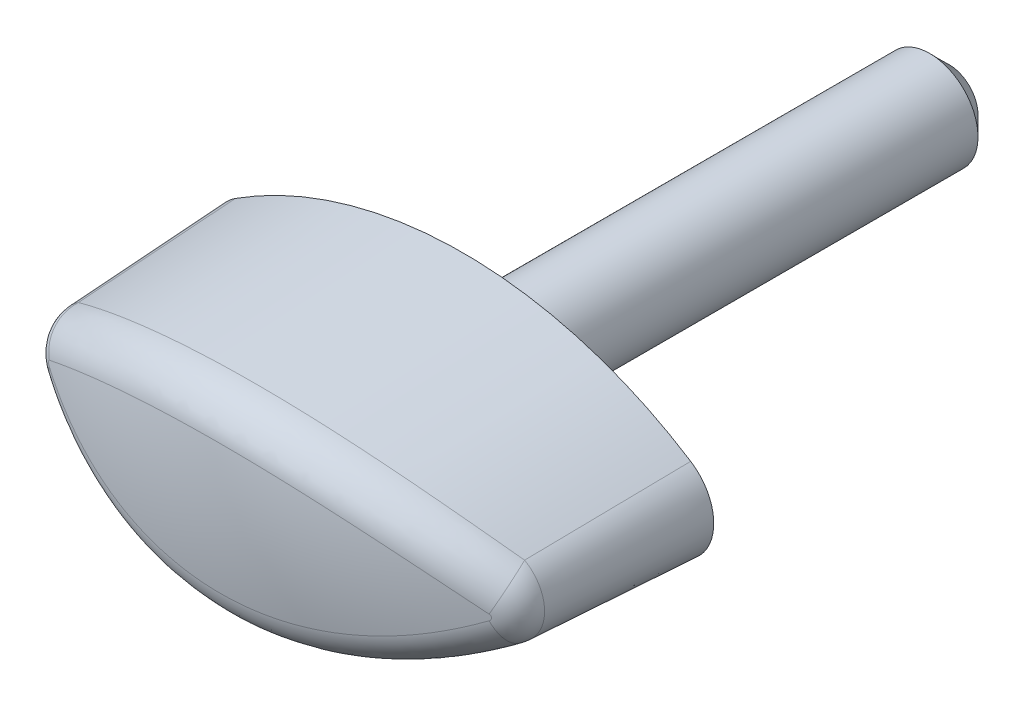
ISO-10303-21;
HEADER;
FILE_DESCRIPTION(('STEP AP214'),'2;1');
FILE_NAME('part.step','',(''),(''),'','','');
FILE_SCHEMA(('AUTOMOTIVE_DESIGN { 1 0 10303 214 1 1 1 1 }'));
ENDSEC;
DATA;
#1=APPLICATION_CONTEXT('core data for automotive mechanical design processes');
#2=APPLICATION_PROTOCOL_DEFINITION('international standard','automotive_design',2000,#1);
#3=PRODUCT_CONTEXT('',#1,'mechanical');
#4=PRODUCT('Part','Part','',(#3));
#5=PRODUCT_RELATED_PRODUCT_CATEGORY('part','',(#4));
#6=PRODUCT_DEFINITION_FORMATION('','',#4);
#7=PRODUCT_DEFINITION_CONTEXT('part definition',#1,'design');
#8=PRODUCT_DEFINITION('design','',#6,#7);
#9=PRODUCT_DEFINITION_SHAPE('','',#8);
#10=(LENGTH_UNIT() NAMED_UNIT(*) SI_UNIT(.MILLI.,.METRE.));
#11=(NAMED_UNIT(*) PLANE_ANGLE_UNIT() SI_UNIT($,.RADIAN.));
#12=(NAMED_UNIT(*) SI_UNIT($,.STERADIAN.) SOLID_ANGLE_UNIT());
#13=UNCERTAINTY_MEASURE_WITH_UNIT(LENGTH_MEASURE(1.E-05),#10,'distance_accuracy_value','');
#14=(GEOMETRIC_REPRESENTATION_CONTEXT(3) GLOBAL_UNCERTAINTY_ASSIGNED_CONTEXT((#13)) GLOBAL_UNIT_ASSIGNED_CONTEXT((#10,
#11,#12)) REPRESENTATION_CONTEXT('',''));
#15=CARTESIAN_POINT('',(0.,0.,0.));
#16=DIRECTION('',(0.,0.,1.));
#17=DIRECTION('',(1.,0.,0.));
#18=AXIS2_PLACEMENT_3D('',#15,#16,#17);
#19=CARTESIAN_POINT('',(0.,16.2061475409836,0.2));
#20=DIRECTION('',(0.,0.,-1.));
#21=DIRECTION('',(1.,0.,0.));
#22=AXIS2_PLACEMENT_3D('',#19,#20,#21);
#23=CONICAL_SURFACE('',#22,21.8561475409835,0.05235987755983);
#24=DIRECTION('',(0.0282659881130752,-0.044046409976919,-0.998629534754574));
#25=VECTOR('',#24,1.);
#26=CARTESIAN_POINT('',(11.8042271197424,-2.18818330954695,0.2));
#27=LINE('',#26,#25);
#28=CARTESIAN_POINT('',(11.5672178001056,-1.81885570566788,8.57347364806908));
#29=VERTEX_POINT('',#28);
#30=CARTESIAN_POINT('',(11.8042271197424,-2.18818330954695,0.2));
#31=VERTEX_POINT('',#30);
#32=EDGE_CURVE('E66',#29,#31,#27,.T.);
#33=ORIENTED_EDGE('',*,*,#32,.F.);
#34=CARTESIAN_POINT('',(16.4271005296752,4.04077128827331,6.40713273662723));
#35=CARTESIAN_POINT('',(17.0926019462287,3.05918648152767,6.02869797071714));
#36=CARTESIAN_POINT('',(16.6525406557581,2.44524763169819,5.03923403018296));
#37=CARTESIAN_POINT('',(16.2585809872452,3.85260775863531,6.59883012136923));
#38=CARTESIAN_POINT('',(16.926208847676,2.85960111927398,6.22100494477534));
#39=CARTESIAN_POINT('',(16.4824342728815,2.25390206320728,5.21559562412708));
#40=CARTESIAN_POINT('',(16.08502906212,3.66508667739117,6.78668348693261));
#41=CARTESIAN_POINT('',(16.7547344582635,2.66078768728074,6.40930934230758));
#42=CARTESIAN_POINT('',(16.3071905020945,2.06319388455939,5.38842072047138));
#43=CARTESIAN_POINT('',(15.7277470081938,3.29210943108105,7.15464886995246));
#44=CARTESIAN_POINT('',(16.4007505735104,2.26460172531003,6.77876476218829));
#45=CARTESIAN_POINT('',(15.9463115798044,1.68384716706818,5.7269488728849));
#46=CARTESIAN_POINT('',(15.5440159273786,3.10665346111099,7.33476016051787));
#47=CARTESIAN_POINT('',(16.218192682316,2.06723845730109,6.95988042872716));
#48=CARTESIAN_POINT('',(15.7606754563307,1.49520882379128,5.89265126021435));
#49=CARTESIAN_POINT('',(14.9771469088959,2.55432799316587,7.86361459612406));
#50=CARTESIAN_POINT('',(15.65212864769,1.4769888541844,7.49378323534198));
#51=CARTESIAN_POINT('',(15.1877641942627,0.933361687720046,6.37919734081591));
#52=CARTESIAN_POINT('',(14.5785877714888,2.19178794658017,8.20058814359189));
#53=CARTESIAN_POINT('',(15.2527614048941,1.08900357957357,7.83420074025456));
#54=CARTESIAN_POINT('',(14.784743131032,0.564512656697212,6.68921300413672));
#55=CARTESIAN_POINT('',(13.7396705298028,1.48408133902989,8.84285513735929));
#56=CARTESIAN_POINT('',(14.4076445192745,0.328451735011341,8.48548173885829));
#57=CARTESIAN_POINT('',(13.9360201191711,-0.155612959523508,7.28009863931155));
#58=CARTESIAN_POINT('',(13.299189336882,1.1389707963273,9.14804941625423));
#59=CARTESIAN_POINT('',(13.9614980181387,-0.0437819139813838,8.79586274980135));
#60=CARTESIAN_POINT('',(13.4901924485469,-0.506832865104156,7.56087737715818));
#61=CARTESIAN_POINT('',(12.3788396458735,0.474007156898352,9.72428583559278));
#62=CARTESIAN_POINT('',(13.0244079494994,-0.76414692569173,9.38421171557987));
#63=CARTESIAN_POINT('',(12.5582956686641,-1.18365619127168,8.09101488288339));
#64=CARTESIAN_POINT('',(11.8989905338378,0.154141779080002,9.99534462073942));
#65=CARTESIAN_POINT('',(12.5333362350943,-1.11189744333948,9.66176439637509));
#66=CARTESIAN_POINT('',(12.0722463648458,-1.50927206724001,8.34038896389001));
#67=CARTESIAN_POINT('',(10.9918679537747,-0.399283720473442,10.4564446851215));
#68=CARTESIAN_POINT('',(11.6009373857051,-1.71581007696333,10.1354756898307));
#69=CARTESIAN_POINT('',(11.1530988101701,-2.07271157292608,8.7646010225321));
#70=CARTESIAN_POINT('',(10.5706790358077,-0.638014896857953,10.6522866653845));
#71=CARTESIAN_POINT('',(11.1660220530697,-1.97724702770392,10.3372887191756));
#72=CARTESIAN_POINT('',(10.7262184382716,-2.31578759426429,8.94477564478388));
#73=CARTESIAN_POINT('',(9.70506863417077,-1.0909288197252,11.0194202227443));
#74=CARTESIAN_POINT('',(10.2686487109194,-2.47499013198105,10.7168267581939));
#75=CARTESIAN_POINT('',(9.84871220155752,-2.77698301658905,9.2825385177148));
#76=CARTESIAN_POINT('',(9.26065066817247,-1.30511526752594,11.1907155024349));
#77=CARTESIAN_POINT('',(9.80629346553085,-2.71099502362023,10.8942922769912));
#78=CARTESIAN_POINT('',(9.39808993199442,-2.99510618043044,9.44013017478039));
#79=CARTESIAN_POINT('',(8.35164218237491,-1.70545052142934,11.5077173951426));
#80=CARTESIAN_POINT('',(8.85709456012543,-3.15360413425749,11.2237259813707));
#81=CARTESIAN_POINT('',(8.47621761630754,-3.40282884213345,9.73177191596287));
#82=CARTESIAN_POINT('',(7.88709122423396,-1.89165136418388,11.6534715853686));
#83=CARTESIAN_POINT('',(8.37049092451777,-3.35994623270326,11.3754857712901));
#84=CARTESIAN_POINT('',(8.00500801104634,-3.59248127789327,9.86586577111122));
#85=CARTESIAN_POINT('',(6.93972810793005,-2.23368053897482,11.9190737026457));
#86=CARTESIAN_POINT('',(7.37482487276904,-3.74016648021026,11.6528309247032));
#87=CARTESIAN_POINT('',(7.04391934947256,-3.94087129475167,10.1102197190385));
#88=CARTESIAN_POINT('',(6.45691596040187,-2.38950888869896,12.0389216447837));
#89=CARTESIAN_POINT('',(6.86606148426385,-3.91373154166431,11.778175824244));
#90=CARTESIAN_POINT('',(6.55404030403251,-4.09960889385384,10.2204798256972));
#91=CARTESIAN_POINT('',(5.47422718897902,-2.66889743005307,12.2524891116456));
#92=CARTESIAN_POINT('',(5.82751619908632,-4.22580082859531,12.0021233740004));
#93=CARTESIAN_POINT('',(5.55684925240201,-4.38422670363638,10.4169618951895));
#94=CARTESIAN_POINT('',(4.97429072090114,-2.7923278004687,12.3461036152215));
#95=CARTESIAN_POINT('',(5.29806954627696,-4.36387330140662,12.1004035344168));
#96=CARTESIAN_POINT('',(5.04947605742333,-4.50997472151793,10.5030872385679));
#97=CARTESIAN_POINT('',(3.96272978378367,-3.00409931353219,12.5060314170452));
#98=CARTESIAN_POINT('',(4.2242075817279,-4.60133740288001,12.2686804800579));
#99=CARTESIAN_POINT('',(4.02277805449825,-4.72572979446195,10.6502208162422));
#100=CARTESIAN_POINT('',(3.45110519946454,-3.0924401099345,12.5723444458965));
#101=CARTESIAN_POINT('',(3.68028447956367,-4.70049066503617,12.3385056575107));
#102=CARTESIAN_POINT('',(3.50345312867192,-4.8157364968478,10.7112288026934));
#103=CARTESIAN_POINT('',(2.41973997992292,-3.23260047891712,12.6772955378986));
#104=CARTESIAN_POINT('',(2.5818111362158,-4.85810549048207,12.4492154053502));
#105=CARTESIAN_POINT('',(2.45650599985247,-4.95854272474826,10.8077838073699));
#106=CARTESIAN_POINT('',(1.89999456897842,-3.28439766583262,12.7159166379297));
#107=CARTESIAN_POINT('',(2.02781849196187,-4.91637456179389,12.4899638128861));
#108=CARTESIAN_POINT('',(1.92887891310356,-5.011319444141,10.8433152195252));
#109=CARTESIAN_POINT('',(0.856813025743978,-3.35050150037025,12.7651719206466));
#110=CARTESIAN_POINT('',(0.91460255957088,-4.99083732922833,12.5420003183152));
#111=CARTESIAN_POINT('',(0.869850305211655,-5.07867371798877,10.8886300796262));
#112=CARTESIAN_POINT('',(0.333377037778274,-3.36480960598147,12.7758071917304));
#113=CARTESIAN_POINT('',(0.355986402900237,-5.00695089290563,12.5532323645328));
#114=CARTESIAN_POINT('',(0.338448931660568,-5.09325275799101,10.898414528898));
#115=CARTESIAN_POINT('',(-0.687903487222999,-3.35591787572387,12.769190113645));
#116=CARTESIAN_POINT('',(-0.734449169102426,-4.99692946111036,12.5462382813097));
#117=CARTESIAN_POINT('',(-0.698369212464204,-5.08419274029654,10.8923268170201));
#118=CARTESIAN_POINT('',(-1.18577326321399,-3.33448127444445,12.7532487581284));
#119=CARTESIAN_POINT('',(-1.26571963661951,-4.97279015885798,12.529403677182));
#120=CARTESIAN_POINT('',(-1.20381178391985,-5.06235030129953,10.877660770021));
#121=CARTESIAN_POINT('',(-2.17741077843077,-3.25774611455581,12.6960336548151));
#122=CARTESIAN_POINT('',(-2.32364698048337,-4.88637248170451,12.4689708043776));
#123=CARTESIAN_POINT('',(-2.21050207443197,-4.98416400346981,10.8250228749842));
#124=CARTESIAN_POINT('',(-2.67117868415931,-3.20244893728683,12.6547609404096));
#125=CARTESIAN_POINT('',(-2.84978564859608,-4.82418127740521,12.4254336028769));
#126=CARTESIAN_POINT('',(-2.71174996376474,-4.92782155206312,10.7870519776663));
#127=CARTESIAN_POINT('',(-3.65072386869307,-3.05889693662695,12.5471607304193));
#128=CARTESIAN_POINT('',(-3.89265326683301,-4.66280856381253,12.3119643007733));
#129=CARTESIAN_POINT('',(-3.70607731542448,-4.78156081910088,10.6880597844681));
#130=CARTESIAN_POINT('',(-4.13650708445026,-2.97066787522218,12.4808528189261));
#131=CARTESIAN_POINT('',(-4.40891081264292,-4.56381017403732,12.2421620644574));
#132=CARTESIAN_POINT('',(-4.19916284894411,-4.69166878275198,10.627056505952));
#133=CARTESIAN_POINT('',(-5.09717290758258,-2.76257685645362,12.3235430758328));
#134=CARTESIAN_POINT('',(-5.42834711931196,-4.33055204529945,12.076689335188));
#135=CARTESIAN_POINT('',(-5.17418741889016,-4.47966509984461,10.4823315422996));
#136=CARTESIAN_POINT('',(-5.57205517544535,-2.64271391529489,12.23254047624));
#137=CARTESIAN_POINT('',(-5.93110791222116,-4.19650152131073,11.9811697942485));
#138=CARTESIAN_POINT('',(-5.65612610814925,-4.35755245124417,10.39860915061));
#139=CARTESIAN_POINT('',(-6.52342620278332,-2.36863314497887,12.0228841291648));
#140=CARTESIAN_POINT('',(-6.93622900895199,-3.89045001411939,11.7613818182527));
#141=CARTESIAN_POINT('',(-6.62152588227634,-4.07834322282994,10.2057253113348));
#142=CARTESIAN_POINT('',(-6.99944348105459,-2.21340563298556,11.9034116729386));
#143=CARTESIAN_POINT('',(-7.43771431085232,-3.71758760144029,11.6364504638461));
#144=CARTESIAN_POINT('',(-7.1045048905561,-3.92021853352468,10.0958106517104));
#145=CARTESIAN_POINT('',(-7.93357302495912,-1.87343069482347,11.6392301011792));
#146=CARTESIAN_POINT('',(-8.4192497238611,-3.33972387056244,11.3606353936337));
#147=CARTESIAN_POINT('',(-8.05215764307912,-3.57392264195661,9.85276360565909));
#148=CARTESIAN_POINT('',(-8.39168486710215,-1.68868257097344,11.4945203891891));
#149=CARTESIAN_POINT('',(-8.89901518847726,-3.13502380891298,11.2099834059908));
#150=CARTESIAN_POINT('',(-8.51683095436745,-3.38575072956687,9.71963067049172));
#151=CARTESIAN_POINT('',(-9.28832878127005,-1.29198854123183,11.1802342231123));
#152=CARTESIAN_POINT('',(-9.83514248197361,-2.69650353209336,10.8834130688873));
#153=CARTESIAN_POINT('',(-9.4261554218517,-2.981738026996,9.43048739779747));
#154=CARTESIAN_POINT('',(-9.72681941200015,-1.07998842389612,11.010608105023));
#155=CARTESIAN_POINT('',(-10.2912719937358,-2.46293111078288,10.7076916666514));
#156=CARTESIAN_POINT('',(-9.87076421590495,-2.76584208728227,9.27443136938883));
#157=CARTESIAN_POINT('',(-10.5811244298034,-0.63209213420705,10.647427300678));
#158=CARTESIAN_POINT('',(-11.1768417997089,-1.9707403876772,10.3322652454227));
#159=CARTESIAN_POINT('',(-10.7368049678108,-2.30975704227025,8.94030502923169));
#160=CARTESIAN_POINT('',(-10.9969353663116,-0.396192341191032,10.4538689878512));
#161=CARTESIAN_POINT('',(-11.6061841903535,-1.71241191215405,10.1328101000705));
#162=CARTESIAN_POINT('',(-11.1582333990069,-2.06956425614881,8.76223138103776));
#163=CARTESIAN_POINT('',(-11.8989748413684,0.154132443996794,9.99535244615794));
#164=CARTESIAN_POINT('',(-12.5333203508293,-1.11190751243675,9.66177236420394));
#165=CARTESIAN_POINT('',(-12.0722304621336,-1.50928157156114,8.34039616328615));
#166=CARTESIAN_POINT('',(-12.3788134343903,0.473989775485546,9.72430057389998));
#167=CARTESIAN_POINT('',(-13.0243812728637,-0.764165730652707,9.38422673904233));
#168=CARTESIAN_POINT('',(-12.5582691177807,-1.18367388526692,8.0910284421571));
#169=CARTESIAN_POINT('',(-13.2991488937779,1.13894001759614,9.14807641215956));
#170=CARTESIAN_POINT('',(-13.9614569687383,-0.0438151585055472,8.79589023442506));
#171=CARTESIAN_POINT('',(-13.490151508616,-0.50686419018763,7.56090221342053));
#172=CARTESIAN_POINT('',(-13.7396257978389,1.48404557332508,8.84288698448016));
#173=CARTESIAN_POINT('',(-14.4075993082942,0.328413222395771,8.48551407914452));
#174=CARTESIAN_POINT('',(-13.935974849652,-0.15564935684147,7.2801279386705));
#175=CARTESIAN_POINT('',(-14.5785517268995,2.19175557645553,8.20061812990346));
#176=CARTESIAN_POINT('',(-15.2527251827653,1.08896883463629,7.83423112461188));
#177=CARTESIAN_POINT('',(-14.7847066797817,0.564479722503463,6.68924059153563));
#178=CARTESIAN_POINT('',(-14.9771223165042,2.55430469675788,7.86363664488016));
#179=CARTESIAN_POINT('',(-15.6521040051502,1.47696388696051,7.49380555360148));
#180=CARTESIAN_POINT('',(-15.1877393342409,0.933337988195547,6.37921762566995));
#181=CARTESIAN_POINT('',(-15.5440042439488,3.10664174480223,7.33477150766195));
#182=CARTESIAN_POINT('',(-16.2181810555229,2.06722597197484,6.95989185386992));
#183=CARTESIAN_POINT('',(-15.7606636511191,1.49519690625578,5.89266169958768));
#184=CARTESIAN_POINT('',(-15.7277377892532,3.29209996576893,7.15465813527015));
#185=CARTESIAN_POINT('',(-16.4007414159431,2.26459165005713,6.7787740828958));
#186=CARTESIAN_POINT('',(-15.9463022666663,1.68383753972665,5.72695739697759));
#187=CARTESIAN_POINT('',(-16.085024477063,3.66508173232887,6.78668843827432));
#188=CARTESIAN_POINT('',(-16.7547299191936,2.66078243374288,6.40931431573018));
#189=CARTESIAN_POINT('',(-16.3071858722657,2.06318885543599,5.38842527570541));
#190=CARTESIAN_POINT('',(-16.2585785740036,3.85260508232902,6.59883284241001));
#191=CARTESIAN_POINT('',(-16.9262064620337,2.85959827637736,6.22100767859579));
#192=CARTESIAN_POINT('',(-16.4824318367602,2.25389934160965,5.21559812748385));
#193=CARTESIAN_POINT('',(-16.4271001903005,4.04077090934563,6.40713312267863));
#194=CARTESIAN_POINT('',(-17.0926016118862,3.05918608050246,6.02869835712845));
#195=CARTESIAN_POINT('',(-16.6525403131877,2.44524724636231,5.03923438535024));
#196=(BOUNDED_SURFACE() B_SPLINE_SURFACE(3,2,((#34,#35,#36),(#37,#38,#39),(#40,#41,#42),(#43,
#44,#45),(#46,#47,#48),(#49,#50,#51),(#52,#53,#54),(#55,#56,#57),(#58,#59,#60),(#61,#62,#63),
(#64,#65,#66),(#67,#68,#69),(#70,#71,#72),(#73,#74,#75),(#76,#77,#78),(#79,#80,#81),(#82,#83,
#84),(#85,#86,#87),(#88,#89,#90),(#91,#92,#93),(#94,#95,#96),(#97,#98,#99),(#100,#101,#102),
(#103,#104,#105),(#106,#107,#108),(#109,#110,#111),(#112,#113,#114),(#115,#116,#117),(#118,#119,
#120),(#121,#122,#123),(#124,#125,#126),(#127,#128,#129),(#130,#131,#132),(#133,#134,#135),
(#136,#137,#138),(#139,#140,#141),(#142,#143,#144),(#145,#146,#147),(#148,#149,#150),(#151,#152,
#153),(#154,#155,#156),(#157,#158,#159),(#160,#161,#162),(#163,#164,#165),(#166,#167,#168),
(#169,#170,#171),(#172,#173,#174),(#175,#176,#177),(#178,#179,#180),(#181,#182,#183),(#184,#185,
#186),(#187,#188,#189),(#190,#191,#192),(#193,#194,#195)),.UNSPECIFIED.,.F.,.F.,
.F.) B_SPLINE_SURFACE_WITH_KNOTS((4,2,2,2,2,2,2,2,2,2,2,2,2,2,2,2,2,2,2,2,2,2,2,2,2,2,4),(3,3),
(0.,0.875075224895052,1.7502324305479,3.50187037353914,5.25882008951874,7.01490975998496,
8.45488787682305,9.89464856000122,11.33169810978,12.7687468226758,14.2114689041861,
15.6542052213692,17.097824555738,18.5413877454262,19.9158269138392,21.2902100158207,
22.6635202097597,24.0368731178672,25.4558847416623,26.8749299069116,28.2968429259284,
29.7189716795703,31.4750152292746,33.2319443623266,34.9836274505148,35.858795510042,
36.7338813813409),(0.,1.),
.UNSPECIFIED.) GEOMETRIC_REPRESENTATION_ITEM() RATIONAL_B_SPLINE_SURFACE(((1.,0.848982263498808,
1.),(1.,0.84709050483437,1.),(1.,0.845197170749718,1.),(1.,0.841415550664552,1.),(1.,
0.839527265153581,1.),(1.,0.833879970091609,1.),(1.,0.830141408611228,1.),(1.,0.82278429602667,
1.),(1.,0.819166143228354,1.),(1.,0.812141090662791,1.),(1.,0.80873408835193,1.),(1.,
0.802797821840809,1.),(1.,0.800220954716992,1.),(1.,0.795306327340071,1.),(1.,0.792968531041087,
1.),(1.,0.788578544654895,1.),(1.,0.786525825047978,1.),(1.,0.782740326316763,1.),(1.,
0.781007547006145,1.),(1.,0.777891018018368,1.),(1.,0.776508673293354,1.),(1.,0.774131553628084,
1.),(1.,0.773136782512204,1.),(1.,0.77155636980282,1.),(1.,0.770970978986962,1.),(1.,
0.770223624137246,1.),(1.,0.770061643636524,1.),(1.,0.770162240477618,1.),(1.,0.770404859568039,
1.),(1.,0.771272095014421,1.),(1.,0.771896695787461,1.),(1.,0.773514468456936,1.),(1.,
0.774507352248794,1.),(1.,0.77684190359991,1.),(1.,0.778183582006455,1.),(1.,0.781239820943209,
1.),(1.,0.782965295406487,1.),(1.,0.786726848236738,1.),(1.,0.788762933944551,1.),(1.,
0.793111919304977,1.),(1.,0.79542537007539,1.),(1.,0.800284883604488,1.),(1.,0.802830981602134,
1.),(1.,0.808733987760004,1.),(1.,0.812140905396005,1.),(1.,0.819165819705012,1.),(1.,
0.822783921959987,1.),(1.,0.830141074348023,1.),(1.,0.83387973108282,1.),(1.,0.839527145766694,
1.),(1.,0.841415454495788,1.),(1.,0.845197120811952,1.),(1.,0.847090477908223,1.),(1.,
0.848982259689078,1.))) REPRESENTATION_ITEM('') SURFACE());
#197=CARTESIAN_POINT('',(16.6525406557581,2.44524763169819,5.03923403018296));
#198=CARTESIAN_POINT('',(16.4824342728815,2.25390206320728,5.21559562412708));
#199=CARTESIAN_POINT('',(16.3071905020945,2.06319388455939,5.38842072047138));
#200=CARTESIAN_POINT('',(15.9463115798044,1.68384716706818,5.7269488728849));
#201=CARTESIAN_POINT('',(15.7606754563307,1.49520882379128,5.89265126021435));
#202=CARTESIAN_POINT('',(15.1877641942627,0.933361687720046,6.37919734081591));
#203=CARTESIAN_POINT('',(14.784743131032,0.564512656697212,6.68921300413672));
#204=CARTESIAN_POINT('',(13.9360201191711,-0.155612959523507,7.28009863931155));
#205=CARTESIAN_POINT('',(13.4901924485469,-0.506832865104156,7.56087737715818));
#206=CARTESIAN_POINT('',(12.5582956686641,-1.18365619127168,8.09101488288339));
#207=CARTESIAN_POINT('',(12.0722463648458,-1.50927206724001,8.34038896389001));
#208=CARTESIAN_POINT('',(11.1530988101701,-2.07271157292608,8.7646010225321));
#209=CARTESIAN_POINT('',(10.7262184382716,-2.31578759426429,8.94477564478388));
#210=CARTESIAN_POINT('',(9.84871220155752,-2.77698301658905,9.2825385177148));
#211=CARTESIAN_POINT('',(9.39808993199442,-2.99510618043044,9.44013017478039));
#212=CARTESIAN_POINT('',(8.47621761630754,-3.40282884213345,9.73177191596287));
#213=CARTESIAN_POINT('',(8.00500801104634,-3.59248127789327,9.86586577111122));
#214=CARTESIAN_POINT('',(7.04391934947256,-3.94087129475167,10.1102197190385));
#215=CARTESIAN_POINT('',(6.55404030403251,-4.09960889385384,10.2204798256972));
#216=CARTESIAN_POINT('',(5.55684925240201,-4.38422670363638,10.4169618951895));
#217=CARTESIAN_POINT('',(5.04947605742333,-4.50997472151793,10.5030872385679));
#218=CARTESIAN_POINT('',(4.02277805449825,-4.72572979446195,10.6502208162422));
#219=CARTESIAN_POINT('',(3.50345312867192,-4.8157364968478,10.7112288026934));
#220=CARTESIAN_POINT('',(2.45650599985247,-4.95854272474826,10.8077838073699));
#221=CARTESIAN_POINT('',(1.92887891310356,-5.011319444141,10.8433152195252));
#222=CARTESIAN_POINT('',(0.869850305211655,-5.07867371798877,10.8886300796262));
#223=CARTESIAN_POINT('',(0.33844893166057,-5.09325275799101,10.898414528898));
#224=CARTESIAN_POINT('',(-0.698369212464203,-5.08419274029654,10.8923268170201));
#225=CARTESIAN_POINT('',(-1.20381178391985,-5.06235030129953,10.877660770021));
#226=CARTESIAN_POINT('',(-2.21050207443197,-4.98416400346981,10.8250228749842));
#227=CARTESIAN_POINT('',(-2.71174996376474,-4.92782155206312,10.7870519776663));
#228=CARTESIAN_POINT('',(-3.70607731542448,-4.78156081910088,10.6880597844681));
#229=CARTESIAN_POINT('',(-4.19916284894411,-4.69166878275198,10.627056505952));
#230=CARTESIAN_POINT('',(-5.17418741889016,-4.47966509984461,10.4823315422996));
#231=CARTESIAN_POINT('',(-5.65612610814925,-4.35755245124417,10.39860915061));
#232=CARTESIAN_POINT('',(-6.62152588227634,-4.07834322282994,10.2057253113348));
#233=CARTESIAN_POINT('',(-7.1045048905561,-3.92021853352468,10.0958106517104));
#234=CARTESIAN_POINT('',(-8.05215764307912,-3.57392264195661,9.85276360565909));
#235=CARTESIAN_POINT('',(-8.51683095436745,-3.38575072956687,9.71963067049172));
#236=CARTESIAN_POINT('',(-9.4261554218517,-2.981738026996,9.43048739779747));
#237=CARTESIAN_POINT('',(-9.87076421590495,-2.76584208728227,9.27443136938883));
#238=CARTESIAN_POINT('',(-10.7368049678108,-2.30975704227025,8.94030502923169));
#239=CARTESIAN_POINT('',(-11.1582333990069,-2.06956425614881,8.76223138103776));
#240=CARTESIAN_POINT('',(-12.0722304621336,-1.50928157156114,8.34039616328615));
#241=CARTESIAN_POINT('',(-12.5582691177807,-1.18367388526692,8.0910284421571));
#242=CARTESIAN_POINT('',(-13.490151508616,-0.50686419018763,7.56090221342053));
#243=CARTESIAN_POINT('',(-13.935974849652,-0.15564935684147,7.2801279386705));
#244=CARTESIAN_POINT('',(-14.7847066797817,0.564479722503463,6.68924059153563));
#245=CARTESIAN_POINT('',(-15.1877393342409,0.933337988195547,6.37921762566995));
#246=CARTESIAN_POINT('',(-15.7606636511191,1.49519690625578,5.89266169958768));
#247=CARTESIAN_POINT('',(-15.9463022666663,1.68383753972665,5.72695739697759));
#248=CARTESIAN_POINT('',(-16.3071858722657,2.06318885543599,5.38842527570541));
#249=CARTESIAN_POINT('',(-16.4824318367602,2.25389934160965,5.21559812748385));
#250=CARTESIAN_POINT('',(-16.6525403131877,2.44524724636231,5.03923438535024));
#251=B_SPLINE_CURVE_WITH_KNOTS('',3,(#197,#198,#199,#200,#201,#202,#203,#204,#205,#206,#207,
#208,#209,#210,#211,#212,#213,#214,#215,#216,#217,#218,#219,#220,#221,#222,#223,#224,#225,#226,
#227,#228,#229,#230,#231,#232,#233,#234,#235,#236,#237,#238,#239,#240,#241,#242,#243,#244,#245,
#246,#247,#248,#249,#250),.UNSPECIFIED.,.F.,.F.,(4,2,2,2,2,2,2,2,2,2,2,2,2,2,2,2,2,2,2,2,2,2,2,
2,2,2,4),(0.,0.875075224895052,1.7502324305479,3.50187037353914,5.25882008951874,
7.01490975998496,8.45488787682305,9.89464856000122,11.33169810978,12.7687468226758,
14.2114689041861,15.6542052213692,17.097824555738,18.5413877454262,19.9158269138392,
21.2902100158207,22.6635202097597,24.0368731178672,25.4558847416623,26.8749299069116,
28.2968429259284,29.7189716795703,31.4750152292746,33.2319443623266,34.9836274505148,
35.858795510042,36.7338813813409),.UNSPECIFIED.);
#252=CARTESIAN_POINT('',(-11.5672173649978,-1.81885597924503,8.57347373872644));
#253=VERTEX_POINT('',#252);
#254=EDGE_CURVE('E29',#29,#253,#251,.T.);
#255=ORIENTED_EDGE('',*,*,#254,.T.);
#256=DIRECTION('',(-0.0282659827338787,-0.0440464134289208,-0.998629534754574));
#257=VECTOR('',#256,1.);
#258=CARTESIAN_POINT('',(-11.8042266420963,-2.18818361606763,0.2));
#259=LINE('',#258,#257);
#260=CARTESIAN_POINT('',(-11.8042266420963,-2.18818361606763,0.2));
#261=VERTEX_POINT('',#260);
#262=EDGE_CURVE('E84',#253,#261,#259,.T.);
#263=ORIENTED_EDGE('',*,*,#262,.T.);
#264=CARTESIAN_POINT('',(0.,16.2061475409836,0.2));
#265=DIRECTION('',(0.,0.,1.));
#266=DIRECTION('',(1.,0.,0.));
#267=AXIS2_PLACEMENT_3D('',#264,#265,#266);
#268=CIRCLE('',#267,21.8561475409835);
#269=EDGE_CURVE('E80',#261,#31,#268,.T.);
#270=ORIENTED_EDGE('',*,*,#269,.T.);
#271=EDGE_LOOP('',(#33,#255,#263,#270));
#272=FACE_BOUND('',#271,.T.);
#273=ADVANCED_FACE('F14',(#272),#23,.T.);
#274=CARTESIAN_POINT('',(10.4,0.,0.2));
#275=DIRECTION('',(0.,0.,-1.));
#276=DIRECTION('',(1.,0.,0.));
#277=AXIS2_PLACEMENT_3D('',#274,#275,#276);
#278=CONICAL_SURFACE('',#277,2.6,0.05235987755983);
#279=DIRECTION('',(0.0282659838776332,0.0440464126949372,-0.998629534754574));
#280=VECTOR('',#279,1.);
#281=CARTESIAN_POINT('',(11.8042271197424,2.18818330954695,0.2));
#282=LINE('',#281,#280);
#283=CARTESIAN_POINT('',(11.5672178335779,1.81885567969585,8.57347372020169));
#284=VERTEX_POINT('',#283);
#285=CARTESIAN_POINT('',(11.8042271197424,2.18818330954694,0.2));
#286=VERTEX_POINT('',#285);
#287=EDGE_CURVE('E73',#284,#286,#282,.T.);
#288=ORIENTED_EDGE('',*,*,#287,.F.);
#289=CARTESIAN_POINT('',(11.3400690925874,0.172896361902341,10.2794286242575));
#290=CARTESIAN_POINT('',(11.5780599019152,1.87931271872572,10.1450506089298));
#291=CARTESIAN_POINT('',(10.8369727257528,2.11501444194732,8.60174624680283));
#292=CARTESIAN_POINT('',(11.3506112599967,0.17101013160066,10.2740774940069));
#293=CARTESIAN_POINT('',(11.6642783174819,1.81641301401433,10.1016539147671));
#294=CARTESIAN_POINT('',(10.9653127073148,2.08881990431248,8.59682320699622));
#295=CARTESIAN_POINT('',(11.3610262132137,0.168141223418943,10.2687888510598));
#296=CARTESIAN_POINT('',(11.744830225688,1.74757226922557,10.0611041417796));
#297=CARTESIAN_POINT('',(11.0914965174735,2.05078298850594,8.59195765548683));
#298=CARTESIAN_POINT('',(11.3813028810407,0.160477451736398,10.2584890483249));
#299=CARTESIAN_POINT('',(11.8928044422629,1.60137455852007,9.98660547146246));
#300=CARTESIAN_POINT('',(11.3361678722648,1.95181480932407,8.58248183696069));
#301=CARTESIAN_POINT('',(11.3911631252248,0.155677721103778,10.2534786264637));
#302=CARTESIAN_POINT('',(11.9606185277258,1.52401777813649,9.95245949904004));
#303=CARTESIAN_POINT('',(11.4546350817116,1.89082571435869,8.57787224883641));
#304=CARTESIAN_POINT('',(11.4088520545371,0.144886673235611,10.2444872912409));
#305=CARTESIAN_POINT('',(12.0764993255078,1.37214420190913,9.89410390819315));
#306=CARTESIAN_POINT('',(11.6663621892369,1.7554763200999,8.56960022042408));
#307=CARTESIAN_POINT('',(11.4167827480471,0.139105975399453,10.2404548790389));
#308=CARTESIAN_POINT('',(12.1261163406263,1.29848252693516,9.86911459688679));
#309=CARTESIAN_POINT('',(11.7609430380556,1.68358103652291,8.56589040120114));
#310=CARTESIAN_POINT('',(11.4316870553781,0.126168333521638,10.2328748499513));
#311=CARTESIAN_POINT('',(12.2159872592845,1.14686018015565,9.82384714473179));
#312=CARTESIAN_POINT('',(11.9381750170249,1.52386035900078,8.55891677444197));
#313=CARTESIAN_POINT('',(11.4386617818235,0.119013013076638,10.2293266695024));
#314=CARTESIAN_POINT('',(12.2564694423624,1.06880763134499,9.80345409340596));
#315=CARTESIAN_POINT('',(12.0208400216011,1.43605376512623,8.55565244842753));
#316=CARTESIAN_POINT('',(11.4514345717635,0.103406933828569,10.2228275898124));
#317=CARTESIAN_POINT('',(12.3284346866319,0.908629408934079,9.76719813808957));
#318=CARTESIAN_POINT('',(12.1718602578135,1.24554657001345,8.54967329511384));
#319=CARTESIAN_POINT('',(11.4572262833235,0.0949495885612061,10.2198799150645));
#320=CARTESIAN_POINT('',(12.3600595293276,0.826331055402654,9.75126382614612));
#321=CARTESIAN_POINT('',(12.2401383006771,1.14277039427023,8.54696143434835));
#322=CARTESIAN_POINT('',(11.4673165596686,0.0769732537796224,10.2147437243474));
#323=CARTESIAN_POINT('',(12.4139453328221,0.65881478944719,9.72411135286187));
#324=CARTESIAN_POINT('',(12.3588786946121,0.925121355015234,8.5422361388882));
#325=CARTESIAN_POINT('',(11.4716155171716,0.0674545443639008,10.2125550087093));
#326=CARTESIAN_POINT('',(12.436359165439,0.573401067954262,9.7128161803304));
#327=CARTESIAN_POINT('',(12.4093457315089,0.810251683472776,8.54022252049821));
#328=CARTESIAN_POINT('',(11.4781806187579,0.0485336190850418,10.2092122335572));
#329=CARTESIAN_POINT('',(12.4701103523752,0.408222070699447,9.69580694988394));
#330=CARTESIAN_POINT('',(12.4863326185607,0.582446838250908,8.5371471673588));
#331=CARTESIAN_POINT('',(11.480592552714,0.0391951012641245,10.2079839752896));
#332=CARTESIAN_POINT('',(12.4823261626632,0.328469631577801,9.68965027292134));
#333=CARTESIAN_POINT('',(12.514571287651,0.470233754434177,8.53601716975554));
#334=CARTESIAN_POINT('',(11.4838532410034,0.0201820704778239,10.2063234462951));
#335=CARTESIAN_POINT('',(12.4987378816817,0.168216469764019,9.68137876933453));
#336=CARTESIAN_POINT('',(12.5527336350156,0.242009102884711,8.53448948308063));
#337=CARTESIAN_POINT('',(11.4847029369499,0.010507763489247,10.205890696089));
#338=CARTESIAN_POINT('',(12.5029806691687,0.087514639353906,9.679240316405));
#339=CARTESIAN_POINT('',(12.5626683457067,0.125999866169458,8.53409135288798));
#340=CARTESIAN_POINT('',(11.4847915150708,-0.00810013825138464,10.205845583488));
#341=CARTESIAN_POINT('',(12.5034227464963,-0.0674578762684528,9.67901750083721));
#342=CARTESIAN_POINT('',(12.5637040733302,-0.0971297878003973,8.53404984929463));
#343=CARTESIAN_POINT('',(11.4841496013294,-0.0170333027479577,10.2061725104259));
#344=CARTESIAN_POINT('',(12.5002185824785,-0.141915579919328,9.6806324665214));
#345=CARTESIAN_POINT('',(12.5561988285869,-0.204245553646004,8.53435062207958));
#346=CARTESIAN_POINT('',(11.4815287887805,-0.0346471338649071,10.2075071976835));
#347=CARTESIAN_POINT('',(12.4870513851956,-0.289940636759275,9.68726877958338));
#348=CARTESIAN_POINT('',(12.5255307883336,-0.415620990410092,8.53557853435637));
#349=CARTESIAN_POINT('',(11.479550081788,-0.0433278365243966,10.2085148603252));
#350=CARTESIAN_POINT('',(12.4770605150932,-0.363667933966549,9.69230415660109));
#351=CARTESIAN_POINT('',(12.5023702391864,-0.519881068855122,8.5365055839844));
#352=CARTESIAN_POINT('',(11.4743596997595,-0.0601529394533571,10.2111577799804));
#353=CARTESIAN_POINT('',(12.4505320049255,-0.509143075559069,9.70567373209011));
#354=CARTESIAN_POINT('',(12.441535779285,-0.722288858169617,8.53893707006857));
#355=CARTESIAN_POINT('',(11.4711551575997,-0.0683001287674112,10.2127894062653));
#356=CARTESIAN_POINT('',(12.4339763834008,-0.581045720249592,9.71401699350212));
#357=CARTESIAN_POINT('',(12.4039458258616,-0.820468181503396,8.54043816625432));
#358=CARTESIAN_POINT('',(11.4636400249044,-0.0839260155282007,10.2166152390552));
#359=CARTESIAN_POINT('',(12.3944606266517,-0.722801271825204,9.7339296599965));
#360=CARTESIAN_POINT('',(12.3156335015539,-1.0092261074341,8.54395793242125));
#361=CARTESIAN_POINT('',(11.4593288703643,-0.0914043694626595,10.218809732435));
#362=CARTESIAN_POINT('',(12.3714183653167,-0.792777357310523,9.74554044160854));
#363=CARTESIAN_POINT('',(12.264904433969,-1.09980080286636,8.54597686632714));
#364=CARTESIAN_POINT('',(11.4494533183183,-0.10598631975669,10.2238357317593));
#365=CARTESIAN_POINT('',(12.3173986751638,-0.934535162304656,9.7727581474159));
#366=CARTESIAN_POINT('',(12.1484446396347,-1.27698499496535,8.55060078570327));
#367=CARTESIAN_POINT('',(11.4438274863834,-0.113037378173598,10.2266984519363));
#368=CARTESIAN_POINT('',(12.2859148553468,-1.00623713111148,9.78862006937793));
#369=CARTESIAN_POINT('',(12.0819751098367,-1.3629939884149,8.55323448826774));
#370=CARTESIAN_POINT('',(11.4316934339,-0.126091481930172,10.2328714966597));
#371=CARTESIAN_POINT('',(12.2159340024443,-1.14627092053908,9.82387369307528));
#372=CARTESIAN_POINT('',(11.9382199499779,-1.52294548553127,8.5589136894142));
#373=CARTESIAN_POINT('',(11.4251859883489,-0.132095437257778,10.2361814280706));
#374=CARTESIAN_POINT('',(12.177302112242,-1.21469831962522,9.84333329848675));
#375=CARTESIAN_POINT('',(11.8609438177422,-1.59689846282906,8.56195882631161));
#376=CARTESIAN_POINT('',(11.4126351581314,-0.142063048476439,10.2425636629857));
#377=CARTESIAN_POINT('',(12.1001829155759,-1.33635978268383,9.88217559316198));
#378=CARTESIAN_POINT('',(11.711455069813,-1.72039374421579,8.56783048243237));
#379=CARTESIAN_POINT('',(11.4066996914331,-0.146200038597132,10.2455813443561));
#380=CARTESIAN_POINT('',(12.0626089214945,-1.39035123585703,9.90109887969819));
#381=CARTESIAN_POINT('',(11.6405996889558,-1.77194911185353,8.57060674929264));
#382=CARTESIAN_POINT('',(11.3912079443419,-0.155649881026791,10.253455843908));
#383=CARTESIAN_POINT('',(11.9609169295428,-1.52362321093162,9.95230922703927));
#384=CARTESIAN_POINT('',(11.45517132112,-1.8904771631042,8.57785128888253));
#385=CARTESIAN_POINT('',(11.3813916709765,-0.160433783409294,10.2584439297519));
#386=CARTESIAN_POINT('',(11.8934207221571,-1.60066776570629,9.98629515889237));
#387=CARTESIAN_POINT('',(11.3372345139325,-1.95126041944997,8.58244032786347));
#388=CARTESIAN_POINT('',(11.3611169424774,-0.168117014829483,10.2687427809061));
#389=CARTESIAN_POINT('',(11.7455251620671,-1.74698463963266,10.0607543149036));
#390=CARTESIAN_POINT('',(11.0925961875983,-2.05046075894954,8.59191527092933));
#391=CARTESIAN_POINT('',(11.3506548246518,-0.17100425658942,10.2740553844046));
#392=CARTESIAN_POINT('',(11.6646334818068,-1.81617039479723,10.1014751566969));
#393=CARTESIAN_POINT('',(10.9658440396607,-2.08873423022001,8.59680286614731));
#394=CARTESIAN_POINT('',(11.3400690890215,-0.172896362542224,10.2794286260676));
#395=CARTESIAN_POINT('',(11.5780598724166,-1.87931274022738,10.1450506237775));
#396=CARTESIAN_POINT('',(10.8369726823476,-2.11501445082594,8.60174624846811));
#397=(BOUNDED_SURFACE() B_SPLINE_SURFACE(3,2,((#289,#290,#291),(#292,#293,#294),(#295,#296,
#297),(#298,#299,#300),(#301,#302,#303),(#304,#305,#306),(#307,#308,#309),(#310,#311,#312),
(#313,#314,#315),(#316,#317,#318),(#319,#320,#321),(#322,#323,#324),(#325,#326,#327),(#328,#329,
#330),(#331,#332,#333),(#334,#335,#336),(#337,#338,#339),(#340,#341,#342),(#343,#344,#345),
(#346,#347,#348),(#349,#350,#351),(#352,#353,#354),(#355,#356,#357),(#358,#359,#360),(#361,#362,
#363),(#364,#365,#366),(#367,#368,#369),(#370,#371,#372),(#373,#374,#375),(#376,#377,#378),
(#379,#380,#381),(#382,#383,#384),(#385,#386,#387),(#388,#389,#390),(#391,#392,#393),(#394,#395,
#396)),.UNSPECIFIED.,.F.,.F.,.F.) B_SPLINE_SURFACE_WITH_KNOTS((4,2,2,2,2,2,2,2,2,2,2,2,2,2,2,2,
2,4),(3,3),(0.,0.0330290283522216,0.0661418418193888,0.0953021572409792,0.124428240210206,
0.153706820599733,0.182977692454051,0.209668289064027,0.236342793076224,0.260959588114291,
0.285572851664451,0.310045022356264,0.334529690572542,0.360542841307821,0.386533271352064,
0.408124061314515,0.441090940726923,0.474265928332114),(0.,1.),
.UNSPECIFIED.) GEOMETRIC_REPRESENTATION_ITEM() RATIONAL_B_SPLINE_SURFACE(((1.,0.756656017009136,
1.),(1.,0.765521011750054,1.),(1.,0.7740726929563,1.),(1.,0.790402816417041,1.),(1.,
0.798179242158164,1.),(1.,0.811895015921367,1.),(1.,0.817942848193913,1.),(1.,0.829165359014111,
1.),(1.,0.834341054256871,1.),(1.,0.843723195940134,1.),(1.,0.847924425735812,1.),(1.,
0.855189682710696,1.),(1.,0.858254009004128,1.),(1.,0.86291312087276,1.),(1.,0.864613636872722,
1.),(1.,0.866909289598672,1.),(1.,0.867505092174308,1.),(1.,0.867567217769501,1.),(1.,
0.867117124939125,1.),(1.,0.86527327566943,1.),(1.,0.863879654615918,1.),(1.,0.860203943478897,
1.),(1.,0.857926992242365,1.),(1.,0.852547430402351,1.),(1.,0.84944439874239,1.),(1.,
0.842270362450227,1.),(1.,0.838151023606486,1.),(1.,0.829161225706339,1.),(1.,0.824291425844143,
1.),(1.,0.814772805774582,1.),(1.,0.810226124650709,1.),(1.,0.798213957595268,1.),(1.,
0.790472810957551,1.),(1.,0.774147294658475,1.),(1.,0.765557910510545,1.),(1.,0.756656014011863,1.))) REPRESENTATION_ITEM('') SURFACE());
#398=CARTESIAN_POINT('',(10.8369727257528,2.11501444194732,8.60174624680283));
#399=CARTESIAN_POINT('',(10.9653127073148,2.08881990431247,8.59682320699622));
#400=CARTESIAN_POINT('',(11.0914965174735,2.05078298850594,8.59195765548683));
#401=CARTESIAN_POINT('',(11.3361678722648,1.95181480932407,8.58248183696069));
#402=CARTESIAN_POINT('',(11.4546350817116,1.89082571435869,8.57787224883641));
#403=CARTESIAN_POINT('',(11.6663621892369,1.7554763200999,8.56960022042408));
#404=CARTESIAN_POINT('',(11.7609430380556,1.68358103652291,8.56589040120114));
#405=CARTESIAN_POINT('',(11.9381750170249,1.52386035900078,8.55891677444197));
#406=CARTESIAN_POINT('',(12.0208400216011,1.43605376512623,8.55565244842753));
#407=CARTESIAN_POINT('',(12.1718602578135,1.24554657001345,8.54967329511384));
#408=CARTESIAN_POINT('',(12.2401383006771,1.14277039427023,8.54696143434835));
#409=CARTESIAN_POINT('',(12.3588786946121,0.925121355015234,8.5422361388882));
#410=CARTESIAN_POINT('',(12.4093457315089,0.810251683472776,8.54022252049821));
#411=CARTESIAN_POINT('',(12.4863326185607,0.582446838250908,8.5371471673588));
#412=CARTESIAN_POINT('',(12.514571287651,0.470233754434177,8.53601716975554));
#413=CARTESIAN_POINT('',(12.5527336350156,0.242009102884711,8.53448948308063));
#414=CARTESIAN_POINT('',(12.5626683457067,0.125999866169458,8.53409135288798));
#415=CARTESIAN_POINT('',(12.5637040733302,-0.0971297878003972,8.53404984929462));
#416=CARTESIAN_POINT('',(12.5561988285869,-0.204245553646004,8.53435062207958));
#417=CARTESIAN_POINT('',(12.5255307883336,-0.415620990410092,8.53557853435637));
#418=CARTESIAN_POINT('',(12.5023702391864,-0.519881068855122,8.5365055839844));
#419=CARTESIAN_POINT('',(12.441535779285,-0.722288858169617,8.53893707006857));
#420=CARTESIAN_POINT('',(12.4039458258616,-0.820468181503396,8.54043816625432));
#421=CARTESIAN_POINT('',(12.3156335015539,-1.0092261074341,8.54395793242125));
#422=CARTESIAN_POINT('',(12.264904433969,-1.09980080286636,8.54597686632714));
#423=CARTESIAN_POINT('',(12.1484446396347,-1.27698499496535,8.55060078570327));
#424=CARTESIAN_POINT('',(12.0819751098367,-1.3629939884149,8.55323448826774));
#425=CARTESIAN_POINT('',(11.9382199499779,-1.52294548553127,8.5589136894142));
#426=CARTESIAN_POINT('',(11.8609438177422,-1.59689846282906,8.56195882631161));
#427=CARTESIAN_POINT('',(11.711455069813,-1.72039374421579,8.56783048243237));
#428=CARTESIAN_POINT('',(11.6405996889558,-1.77194911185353,8.57060674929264));
#429=CARTESIAN_POINT('',(11.45517132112,-1.8904771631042,8.57785128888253));
#430=CARTESIAN_POINT('',(11.3372345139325,-1.95126041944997,8.58244032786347));
#431=CARTESIAN_POINT('',(11.0925961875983,-2.05046075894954,8.59191527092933));
#432=CARTESIAN_POINT('',(10.9658440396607,-2.08873423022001,8.59680286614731));
#433=CARTESIAN_POINT('',(10.8369726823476,-2.11501445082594,8.60174624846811));
#434=B_SPLINE_CURVE_WITH_KNOTS('',3,(#398,#399,#400,#401,#402,#403,#404,#405,#406,#407,#408,
#409,#410,#411,#412,#413,#414,#415,#416,#417,#418,#419,#420,#421,#422,#423,#424,#425,#426,#427,
#428,#429,#430,#431,#432,#433),.UNSPECIFIED.,.F.,.F.,(4,2,2,2,2,2,2,2,2,2,2,2,2,2,2,2,2,4),(0.,
0.0330290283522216,0.0661418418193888,0.0953021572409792,0.124428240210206,0.153706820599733,
0.182977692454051,0.209668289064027,0.236342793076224,0.260959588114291,0.285572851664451,
0.310045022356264,0.334529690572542,0.360542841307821,0.386533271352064,0.408124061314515,
0.441090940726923,0.474265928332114),.UNSPECIFIED.);
#435=EDGE_CURVE('E37',#284,#29,#434,.T.);
#436=ORIENTED_EDGE('',*,*,#435,.T.);
#437=ORIENTED_EDGE('',*,*,#32,.T.);
#438=CARTESIAN_POINT('',(10.4,0.,0.2));
#439=DIRECTION('',(0.,0.,1.));
#440=DIRECTION('',(1.,0.,0.));
#441=AXIS2_PLACEMENT_3D('',#438,#439,#440);
#442=CIRCLE('',#441,2.6);
#443=EDGE_CURVE('E69',#31,#286,#442,.T.);
#444=ORIENTED_EDGE('',*,*,#443,.T.);
#445=EDGE_LOOP('',(#288,#436,#437,#444));
#446=FACE_BOUND('',#445,.T.);
#447=ADVANCED_FACE('F68',(#446),#278,.T.);
#448=CARTESIAN_POINT('',(0.,-16.2061475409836,0.2));
#449=DIRECTION('',(0.,0.,-1.));
#450=DIRECTION('',(1.,0.,0.));
#451=AXIS2_PLACEMENT_3D('',#448,#449,#450);
#452=CONICAL_SURFACE('',#451,21.8561475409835,0.05235987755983);
#453=DIRECTION('',(-0.0282659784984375,0.0440464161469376,-0.998629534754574));
#454=VECTOR('',#453,1.);
#455=CARTESIAN_POINT('',(-11.8042266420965,2.18818361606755,0.2));
#456=LINE('',#455,#454);
#457=CARTESIAN_POINT('',(-11.5672174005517,1.81885595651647,8.57347373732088));
#458=VERTEX_POINT('',#457);
#459=CARTESIAN_POINT('',(-11.8042266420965,2.18818361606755,0.2));
#460=VERTEX_POINT('',#459);
#461=EDGE_CURVE('E105',#458,#460,#456,.T.);
#462=ORIENTED_EDGE('',*,*,#461,.F.);
#463=CARTESIAN_POINT('',(-16.4271002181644,-4.04077094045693,6.40713309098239));
#464=CARTESIAN_POINT('',(-17.092601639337,-3.05918611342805,6.02869832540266));
#465=CARTESIAN_POINT('',(-16.6525403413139,-2.44524727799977,5.0392343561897));
#466=CARTESIAN_POINT('',(-16.2585806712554,-3.85260741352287,6.59883046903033));
#467=CARTESIAN_POINT('',(-16.9262085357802,-2.85960075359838,6.22100529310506));
#468=CARTESIAN_POINT('',(-16.4824339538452,-2.25390171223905,5.21559594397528));
#469=CARTESIAN_POINT('',(-16.0850287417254,-3.6650863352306,6.78668382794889));
#470=CARTESIAN_POINT('',(-16.754734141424,-2.66078732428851,6.40930968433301));
#471=CARTESIAN_POINT('',(-16.3071901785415,-2.06319353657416,5.38842103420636));
#472=CARTESIAN_POINT('',(-15.7277466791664,-3.29210909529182,7.15464919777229));
#473=CARTESIAN_POINT('',(-16.4007502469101,-2.26460136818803,6.77876509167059));
#474=CARTESIAN_POINT('',(-15.9463112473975,-1.68384682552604,5.72694917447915));
#475=CARTESIAN_POINT('',(-15.5440155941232,-3.10665312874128,7.33476048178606));
#476=CARTESIAN_POINT('',(-16.2181923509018,-2.06723810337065,6.95988075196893));
#477=CARTESIAN_POINT('',(-15.7606751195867,-1.49520848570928,5.89265155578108));
#478=CARTESIAN_POINT('',(-14.9771465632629,-2.55432767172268,7.863614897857));
#479=CARTESIAN_POINT('',(-15.6521283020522,-1.47698851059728,7.49378353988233));
#480=CARTESIAN_POINT('',(-15.1877638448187,-0.933361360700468,6.37919761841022));
#481=CARTESIAN_POINT('',(-14.5785874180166,-2.19178763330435,8.20058843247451));
#482=CARTESIAN_POINT('',(-15.2527610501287,-1.08900324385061,7.83420103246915));
#483=CARTESIAN_POINT('',(-14.7847427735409,-0.564512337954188,6.68921326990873));
#484=CARTESIAN_POINT('',(-13.7396701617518,-1.48408104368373,8.84285540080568));
#485=CARTESIAN_POINT('',(-14.4076441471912,-0.328451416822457,8.48548200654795));
#486=CARTESIAN_POINT('',(-13.9360197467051,0.155613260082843,7.28009888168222));
#487=CARTESIAN_POINT('',(-13.2991889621,-1.13897051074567,9.14804966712));
#488=CARTESIAN_POINT('',(-13.9614976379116,0.0437822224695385,8.79586300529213));
#489=CARTESIAN_POINT('',(-13.4901920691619,0.506833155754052,7.56087760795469));
#490=CARTESIAN_POINT('',(-12.3788392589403,-0.474006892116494,9.724286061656));
#491=CARTESIAN_POINT('',(-13.0244075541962,0.764147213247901,9.38421194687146));
#492=CARTESIAN_POINT('',(-12.5582952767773,1.18365646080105,8.09101509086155));
#493=CARTESIAN_POINT('',(-11.8989901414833,-0.154141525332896,9.99534483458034));
#494=CARTESIAN_POINT('',(-12.5333358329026,1.1118977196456,9.66176461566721));
#495=CARTESIAN_POINT('',(-12.0722459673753,1.50927232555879,8.34038916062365));
#496=CARTESIAN_POINT('',(-10.9918675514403,0.399283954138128,10.4564448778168));
#497=CARTESIAN_POINT('',(-11.6009369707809,1.71581033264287,10.1354758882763));
#498=CARTESIAN_POINT('',(-11.1530984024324,2.07271181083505,8.76460119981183));
#499=CARTESIAN_POINT('',(-10.5706786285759,0.638015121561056,10.6522868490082));
#500=CARTESIAN_POINT('',(-11.1660216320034,1.97724727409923,10.3372889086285));
#501=CARTESIAN_POINT('',(-10.7262180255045,2.31578782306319,8.94477581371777));
#502=CARTESIAN_POINT('',(-9.70506821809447,1.09092902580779,11.0194203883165));
#503=CARTESIAN_POINT('',(-10.2686482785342,2.47499035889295,10.7168269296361));
#504=CARTESIAN_POINT('',(-9.84871177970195,2.77698322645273,9.28253867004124));
#505=CARTESIAN_POINT('',(-9.26065024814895,1.30511546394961,11.1907156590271));
#506=CARTESIAN_POINT('',(-9.80629302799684,2.71099524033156,10.8942924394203));
#507=CARTESIAN_POINT('',(-9.39808950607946,2.995106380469,9.44013031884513));
#508=CARTESIAN_POINT('',(-8.35164175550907,1.70545069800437,11.5077175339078));
#509=CARTESIAN_POINT('',(-8.85709411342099,3.15360432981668,11.2237261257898));
#510=CARTESIAN_POINT('',(-8.47621718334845,3.40282902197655,9.73177204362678));
#511=CARTESIAN_POINT('',(-7.88709079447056,1.89165153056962,11.653471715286));
#512=CARTESIAN_POINT('',(-8.37049047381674,3.35994641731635,11.3754859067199));
#513=CARTESIAN_POINT('',(-8.00500757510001,3.59248144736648,9.8658658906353));
#514=CARTESIAN_POINT('',(-6.93972767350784,2.23368068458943,11.9190738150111));
#515=CARTESIAN_POINT('',(-7.37482441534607,3.74016664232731,11.6528310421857));
#516=CARTESIAN_POINT('',(-7.04391890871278,3.94087144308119,10.1102198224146));
#517=CARTESIAN_POINT('',(-6.45691552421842,2.38950902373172,12.0389217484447));
#518=CARTESIAN_POINT('',(-6.86606102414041,3.91373169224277,11.7781759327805));
#519=CARTESIAN_POINT('',(-6.55403986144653,4.09960903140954,10.2204799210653));
#520=CARTESIAN_POINT('',(-5.47422675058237,2.6688975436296,12.2524891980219));
#521=CARTESIAN_POINT('',(-5.82751573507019,4.22580095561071,12.002123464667));
#522=CARTESIAN_POINT('',(-5.55684880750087,4.38422681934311,10.4169619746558));
#523=CARTESIAN_POINT('',(-4.97429028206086,2.79232790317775,12.3461036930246));
#524=CARTESIAN_POINT('',(-5.29806908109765,4.36387341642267,12.1004036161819));
#525=CARTESIAN_POINT('',(-5.04947561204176,4.50997482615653,10.5030873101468));
#526=CARTESIAN_POINT('',(-3.96272934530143,3.00409939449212,12.5060314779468));
#527=CARTESIAN_POINT('',(-4.22420711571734,4.60133749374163,12.2686805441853));
#528=CARTESIAN_POINT('',(-4.02277760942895,4.72572987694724,10.6502208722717));
#529=CARTESIAN_POINT('',(-3.451104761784,3.09244018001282,12.5723444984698));
#530=CARTESIAN_POINT('',(-3.68028401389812,4.70049074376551,12.3385057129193));
#531=CARTESIAN_POINT('',(-3.50345268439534,4.81573656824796,10.7112288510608));
#532=CARTESIAN_POINT('',(-2.41973954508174,3.23260052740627,12.6772955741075));
#533=CARTESIAN_POINT('',(-2.58181067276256,4.8581055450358,12.4492154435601));
#534=CARTESIAN_POINT('',(-2.45650555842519,4.95854277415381,10.8077838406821));
#535=CARTESIAN_POINT('',(-1.89999413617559,3.28439770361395,12.7159166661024));
#536=CARTESIAN_POINT('',(-2.02781803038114,4.91637460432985,12.4899638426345));
#537=CARTESIAN_POINT('',(-1.92887847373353,5.01131948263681,10.8433152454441));
#538=CARTESIAN_POINT('',(-0.856812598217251,3.35050151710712,12.7651719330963));
#539=CARTESIAN_POINT('',(-0.914602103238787,4.99083734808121,12.5420003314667));
#540=CARTESIAN_POINT('',(-0.869849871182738,5.07867373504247,10.8886300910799));
#541=CARTESIAN_POINT('',(-0.333376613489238,3.36480961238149,12.775807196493));
#542=CARTESIAN_POINT('',(-0.355985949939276,5.00695090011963,12.5532323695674));
#543=CARTESIAN_POINT('',(-0.338448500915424,5.09325276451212,10.8984145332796));
#544=CARTESIAN_POINT('',(0.687903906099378,3.35591786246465,12.7691901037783));
#545=CARTESIAN_POINT('',(0.734449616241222,4.99692944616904,12.5462382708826));
#546=CARTESIAN_POINT('',(0.69836963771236,5.08419272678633,10.8923268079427));
#547=CARTESIAN_POINT('',(1.18577367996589,3.33448125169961,12.7532487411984));
#548=CARTESIAN_POINT('',(1.26572008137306,4.97279013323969,12.5294036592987));
#549=CARTESIAN_POINT('',(1.20381220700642,5.06235027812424,10.8776607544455));
#550=CARTESIAN_POINT('',(2.17741118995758,3.25774607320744,12.696033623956));
#551=CARTESIAN_POINT('',(2.32364741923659,4.88637243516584,12.4689707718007));
#552=CARTESIAN_POINT('',(2.21050249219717,4.98416396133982,10.8250228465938));
#553=CARTESIAN_POINT('',(2.67117909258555,3.20244888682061,12.6547609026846));
#554=CARTESIAN_POINT('',(2.8497860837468,4.82418122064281,12.4254335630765));
#555=CARTESIAN_POINT('',(2.71175037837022,4.92782150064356,10.7870519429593));
#556=CARTESIAN_POINT('',(3.65072427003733,3.05889686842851,12.5471606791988));
#557=CARTESIAN_POINT('',(3.89265369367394,4.662808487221,12.3119642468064));
#558=CARTESIAN_POINT('',(3.70607772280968,4.78156074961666,10.6880597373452));
#559=CARTESIAN_POINT('',(4.13650748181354,2.97066779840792,12.4808527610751));
#560=CARTESIAN_POINT('',(4.40891123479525,4.5638100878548,12.2421620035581));
#561=CARTESIAN_POINT('',(4.19916325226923,4.69166870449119,10.6270564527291));
#562=CARTESIAN_POINT('',(5.09717329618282,2.76257676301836,12.3235430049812));
#563=CARTESIAN_POINT('',(5.42834753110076,4.33055194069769,12.0766892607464));
#564=CARTESIAN_POINT('',(5.17418781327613,4.47966500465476,10.4823314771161));
#565=CARTESIAN_POINT('',(5.57205555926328,2.64271381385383,12.2325403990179));
#566=CARTESIAN_POINT('',(5.93110831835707,4.19650140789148,11.9811697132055));
#567=CARTESIAN_POINT('',(5.65612649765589,4.35755234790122,10.3986090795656));
#568=CARTESIAN_POINT('',(6.52342659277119,2.36863302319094,12.0228840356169));
#569=CARTESIAN_POINT('',(6.93622942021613,3.89044987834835,11.7613817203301));
#570=CARTESIAN_POINT('',(6.62152627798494,4.07834309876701,10.2057252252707));
#571=CARTESIAN_POINT('',(6.99944388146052,2.21340549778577,11.9034115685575));
#572=CARTESIAN_POINT('',(7.43771473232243,3.71758745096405,11.6364503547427));
#573=CARTESIAN_POINT('',(7.10450529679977,3.92021839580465,10.0958105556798));
#574=CARTESIAN_POINT('',(7.93357344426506,1.87343053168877,11.6392299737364));
#575=CARTESIAN_POINT('',(8.41925016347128,3.33972368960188,11.3606352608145));
#576=CARTESIAN_POINT('',(8.05215806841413,3.57392247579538,9.85276348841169));
#577=CARTESIAN_POINT('',(8.39168529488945,1.68868239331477,11.4945202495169));
#578=CARTESIAN_POINT('',(8.89901563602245,3.13502361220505,11.2099832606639));
#579=CARTESIAN_POINT('',(8.51683138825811,3.3857505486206,9.71963054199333));
#580=CARTESIAN_POINT('',(9.28832922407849,1.29198833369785,11.1802340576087));
#581=CARTESIAN_POINT('',(9.83514294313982,2.69650330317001,10.8834128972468));
#582=CARTESIAN_POINT('',(9.42615587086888,2.98173781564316,9.43048724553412));
#583=CARTESIAN_POINT('',(9.72681986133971,1.07998820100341,11.0106079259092));
#584=CARTESIAN_POINT('',(10.2912724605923,2.46293086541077,10.7076914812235));
#585=CARTESIAN_POINT('',(9.87076467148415,2.76584186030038,9.27443120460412));
#586=CARTESIAN_POINT('',(10.581124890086,0.632091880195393,10.6474270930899));
#587=CARTESIAN_POINT('',(11.1768422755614,1.97074010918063,10.3322650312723));
#588=CARTESIAN_POINT('',(10.7368054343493,2.30975678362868,8.94030483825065));
#589=CARTESIAN_POINT('',(10.9969358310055,0.396192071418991,10.4538687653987));
#590=CARTESIAN_POINT('',(11.6061846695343,1.71241161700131,10.1328098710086));
#591=CARTESIAN_POINT('',(11.1582338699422,2.06956398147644,8.76223117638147));
#592=CARTESIAN_POINT('',(11.8989753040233,-0.154132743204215,9.99535219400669));
#593=CARTESIAN_POINT('',(12.5333208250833,1.11190718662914,9.66177210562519));
#594=CARTESIAN_POINT('',(12.0722309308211,1.50928126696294,8.340395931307));
#595=CARTESIAN_POINT('',(12.3788138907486,-0.473990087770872,9.72430030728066));
#596=CARTESIAN_POINT('',(13.0243817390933,0.764165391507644,9.38422646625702));
#597=CARTESIAN_POINT('',(12.5582695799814,1.18367356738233,8.09102819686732));
#598=CARTESIAN_POINT('',(13.299149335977,-1.13894035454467,9.14807611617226));
#599=CARTESIAN_POINT('',(13.9614574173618,0.0438147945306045,8.79588993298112));
#600=CARTESIAN_POINT('',(13.4901519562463,0.506863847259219,7.56090194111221));
#601=CARTESIAN_POINT('',(13.7396262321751,-1.48404592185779,8.84288667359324));
#602=CARTESIAN_POINT('',(14.4075997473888,-0.328413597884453,8.48551376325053));
#603=CARTESIAN_POINT('',(13.9359752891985,0.155649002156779,7.28012765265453));
#604=CARTESIAN_POINT('',(14.5785521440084,-2.19175594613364,8.20061778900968));
#605=CARTESIAN_POINT('',(15.2527256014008,-1.08896923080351,7.8342307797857));
#606=CARTESIAN_POINT('',(14.784707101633,-0.56448009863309,6.68924027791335));
#607=CARTESIAN_POINT('',(14.9771227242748,-2.55430507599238,7.86363628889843));
#608=CARTESIAN_POINT('',(15.6521044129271,-1.47696429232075,7.49380519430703));
#609=CARTESIAN_POINT('',(15.1877397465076,-0.933338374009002,6.37921729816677));
#610=CARTESIAN_POINT('',(15.5440046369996,-3.10664213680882,7.3347711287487));
#611=CARTESIAN_POINT('',(16.2181814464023,-2.06722638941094,6.95989147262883));
#612=CARTESIAN_POINT('',(15.7606640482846,-1.4951973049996,5.89266135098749));
#613=CARTESIAN_POINT('',(15.7277381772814,-3.29210036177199,7.15465774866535));
#614=CARTESIAN_POINT('',(16.4007418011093,-2.26459207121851,6.77877369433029));
#615=CARTESIAN_POINT('',(15.9463026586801,-1.68383794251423,5.72695704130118));
#616=CARTESIAN_POINT('',(16.0850248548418,-3.66508213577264,6.78668803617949));
#617=CARTESIAN_POINT('',(16.7547302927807,-2.66078286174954,6.40931391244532));
#618=CARTESIAN_POINT('',(16.3071862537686,-2.06318926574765,5.38842490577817));
#619=CARTESIAN_POINT('',(16.2585789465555,-3.8526054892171,6.59883243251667));
#620=CARTESIAN_POINT('',(16.9262068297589,-2.85959870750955,6.22100726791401));
#621=CARTESIAN_POINT('',(16.4824322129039,-2.2538997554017,5.21559775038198));
#622=CARTESIAN_POINT('',(16.4271005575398,-4.04077131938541,6.40713270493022));
#623=CARTESIAN_POINT('',(17.0926019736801,-3.0591865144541,6.02869793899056));
#624=CARTESIAN_POINT('',(16.6525406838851,-2.44524766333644,5.0392340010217));
#625=(BOUNDED_SURFACE() B_SPLINE_SURFACE(3,2,((#463,#464,#465),(#466,#467,#468),(#469,#470,
#471),(#472,#473,#474),(#475,#476,#477),(#478,#479,#480),(#481,#482,#483),(#484,#485,#486),
(#487,#488,#489),(#490,#491,#492),(#493,#494,#495),(#496,#497,#498),(#499,#500,#501),(#502,#503,
#504),(#505,#506,#507),(#508,#509,#510),(#511,#512,#513),(#514,#515,#516),(#517,#518,#519),
(#520,#521,#522),(#523,#524,#525),(#526,#527,#528),(#529,#530,#531),(#532,#533,#534),(#535,#536,
#537),(#538,#539,#540),(#541,#542,#543),(#544,#545,#546),(#547,#548,#549),(#550,#551,#552),
(#553,#554,#555),(#556,#557,#558),(#559,#560,#561),(#562,#563,#564),(#565,#566,#567),(#568,#569,
#570),(#571,#572,#573),(#574,#575,#576),(#577,#578,#579),(#580,#581,#582),(#583,#584,#585),
(#586,#587,#588),(#589,#590,#591),(#592,#593,#594),(#595,#596,#597),(#598,#599,#600),(#601,#602,
#603),(#604,#605,#606),(#607,#608,#609),(#610,#611,#612),(#613,#614,#615),(#616,#617,#618),
(#619,#620,#621),(#622,#623,#624)),.UNSPECIFIED.,.F.,.F.,.F.) B_SPLINE_SURFACE_WITH_KNOTS((4,2,
2,2,2,2,2,2,2,2,2,2,2,2,2,2,2,2,2,2,2,2,2,2,2,2,4),(3,3),(0.,0.87507521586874,1.75023241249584,
3.50187033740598,5.25882003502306,7.01490968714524,8.4548877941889,9.89464846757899,
11.3316980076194,12.7687467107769,14.2114687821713,15.6542050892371,17.097824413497,
18.5413875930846,19.9158267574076,21.2902098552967,22.6635200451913,24.036872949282,
25.4558846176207,26.8749298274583,28.2968428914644,29.7189716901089,31.4750152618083,
33.2319444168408,34.9836275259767,35.8587955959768,36.7338814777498),(0.,1.),
.UNSPECIFIED.) GEOMETRIC_REPRESENTATION_ITEM() RATIONAL_B_SPLINE_SURFACE(((1.,0.848982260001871,
1.),(1.,0.847090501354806,1.),(1.,0.845197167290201,1.),(1.,0.841415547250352,1.),(1.,
0.839527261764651,1.),(1.,0.833879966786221,1.),(1.,0.83014140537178,1.),(1.,0.822784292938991,
1.),(1.,0.819166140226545,1.),(1.,0.812141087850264,1.),(1.,0.808734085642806,1.),(1.,
0.802797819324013,1.),(1.,0.800220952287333,1.),(1.,0.795306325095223,1.),(1.,0.792968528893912,
1.),(1.,0.788578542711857,1.),(1.,0.786525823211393,1.),(1.,0.782740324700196,1.),(1.,
0.781007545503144,1.),(1.,0.77789101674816,1.),(1.,0.77650867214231,1.),(1.,0.774131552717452,
1.),(1.,0.77313678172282,1.),(1.,0.771556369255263,1.),(1.,0.770970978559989,1.),(1.,
0.770223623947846,1.),(1.,0.770061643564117,1.),(1.,0.770162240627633,1.),(1.,0.770404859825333,
1.),(1.,0.771272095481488,1.),(1.,0.771896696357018,1.),(1.,0.773514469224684,1.),(1.,
0.774507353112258,1.),(1.,0.77684190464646,1.),(1.,0.778183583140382,1.),(1.,0.781239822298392,
1.),(1.,0.782965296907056,1.),(1.,0.786726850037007,1.),(1.,0.788762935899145,1.),(1.,
0.793111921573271,1.),(1.,0.795425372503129,1.),(1.,0.800284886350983,1.),(1.,0.802830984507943,
1.),(1.,0.808733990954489,1.),(1.,0.812140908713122,1.),(1.,0.819165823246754,1.),(1.,
0.822783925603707,1.),(1.,0.8301410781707,1.),(1.,0.833879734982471,1.),(1.,0.839527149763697,
1.),(1.,0.841415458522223,1.),(1.,0.845197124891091,1.),(1.,0.847090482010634,1.),(1.,
0.848982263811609,1.))) REPRESENTATION_ITEM('') SURFACE());
#626=CARTESIAN_POINT('',(-16.6525403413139,-2.44524727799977,5.0392343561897));
#627=CARTESIAN_POINT('',(-16.4824339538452,-2.25390171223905,5.21559594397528));
#628=CARTESIAN_POINT('',(-16.3071901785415,-2.06319353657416,5.38842103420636));
#629=CARTESIAN_POINT('',(-15.9463112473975,-1.68384682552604,5.72694917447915));
#630=CARTESIAN_POINT('',(-15.7606751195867,-1.49520848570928,5.89265155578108));
#631=CARTESIAN_POINT('',(-15.1877638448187,-0.933361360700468,6.37919761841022));
#632=CARTESIAN_POINT('',(-14.7847427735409,-0.564512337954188,6.68921326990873));
#633=CARTESIAN_POINT('',(-13.9360197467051,0.155613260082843,7.28009888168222));
#634=CARTESIAN_POINT('',(-13.4901920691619,0.506833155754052,7.56087760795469));
#635=CARTESIAN_POINT('',(-12.5582952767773,1.18365646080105,8.09101509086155));
#636=CARTESIAN_POINT('',(-12.0722459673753,1.50927232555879,8.34038916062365));
#637=CARTESIAN_POINT('',(-11.1530984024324,2.07271181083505,8.76460119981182));
#638=CARTESIAN_POINT('',(-10.7262180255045,2.31578782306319,8.94477581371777));
#639=CARTESIAN_POINT('',(-9.84871177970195,2.77698322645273,9.28253867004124));
#640=CARTESIAN_POINT('',(-9.39808950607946,2.995106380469,9.44013031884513));
#641=CARTESIAN_POINT('',(-8.47621718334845,3.40282902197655,9.73177204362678));
#642=CARTESIAN_POINT('',(-8.00500757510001,3.59248144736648,9.8658658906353));
#643=CARTESIAN_POINT('',(-7.04391890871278,3.94087144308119,10.1102198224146));
#644=CARTESIAN_POINT('',(-6.55403986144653,4.09960903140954,10.2204799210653));
#645=CARTESIAN_POINT('',(-5.55684880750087,4.38422681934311,10.4169619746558));
#646=CARTESIAN_POINT('',(-5.04947561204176,4.50997482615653,10.5030873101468));
#647=CARTESIAN_POINT('',(-4.02277760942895,4.72572987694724,10.6502208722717));
#648=CARTESIAN_POINT('',(-3.50345268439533,4.81573656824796,10.7112288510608));
#649=CARTESIAN_POINT('',(-2.45650555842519,4.95854277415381,10.8077838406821));
#650=CARTESIAN_POINT('',(-1.92887847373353,5.01131948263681,10.8433152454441));
#651=CARTESIAN_POINT('',(-0.869849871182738,5.07867373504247,10.8886300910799));
#652=CARTESIAN_POINT('',(-0.338448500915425,5.09325276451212,10.8984145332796));
#653=CARTESIAN_POINT('',(0.69836963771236,5.08419272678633,10.8923268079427));
#654=CARTESIAN_POINT('',(1.20381220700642,5.06235027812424,10.8776607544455));
#655=CARTESIAN_POINT('',(2.21050249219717,4.98416396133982,10.8250228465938));
#656=CARTESIAN_POINT('',(2.71175037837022,4.92782150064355,10.7870519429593));
#657=CARTESIAN_POINT('',(3.70607772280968,4.78156074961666,10.6880597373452));
#658=CARTESIAN_POINT('',(4.19916325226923,4.69166870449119,10.6270564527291));
#659=CARTESIAN_POINT('',(5.17418781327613,4.47966500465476,10.4823314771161));
#660=CARTESIAN_POINT('',(5.65612649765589,4.35755234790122,10.3986090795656));
#661=CARTESIAN_POINT('',(6.62152627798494,4.07834309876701,10.2057252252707));
#662=CARTESIAN_POINT('',(7.10450529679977,3.92021839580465,10.0958105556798));
#663=CARTESIAN_POINT('',(8.05215806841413,3.57392247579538,9.85276348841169));
#664=CARTESIAN_POINT('',(8.51683138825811,3.3857505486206,9.71963054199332));
#665=CARTESIAN_POINT('',(9.42615587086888,2.98173781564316,9.43048724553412));
#666=CARTESIAN_POINT('',(9.87076467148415,2.76584186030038,9.27443120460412));
#667=CARTESIAN_POINT('',(10.7368054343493,2.30975678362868,8.94030483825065));
#668=CARTESIAN_POINT('',(11.1582338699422,2.06956398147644,8.76223117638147));
#669=CARTESIAN_POINT('',(12.0722309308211,1.50928126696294,8.340395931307));
#670=CARTESIAN_POINT('',(12.5582695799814,1.18367356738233,8.09102819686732));
#671=CARTESIAN_POINT('',(13.4901519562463,0.506863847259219,7.56090194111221));
#672=CARTESIAN_POINT('',(13.9359752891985,0.155649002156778,7.28012765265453));
#673=CARTESIAN_POINT('',(14.784707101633,-0.56448009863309,6.68924027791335));
#674=CARTESIAN_POINT('',(15.1877397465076,-0.933338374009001,6.37921729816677));
#675=CARTESIAN_POINT('',(15.7606640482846,-1.4951973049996,5.89266135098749));
#676=CARTESIAN_POINT('',(15.9463026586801,-1.68383794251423,5.72695704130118));
#677=CARTESIAN_POINT('',(16.3071862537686,-2.06318926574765,5.38842490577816));
#678=CARTESIAN_POINT('',(16.4824322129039,-2.2538997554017,5.21559775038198));
#679=CARTESIAN_POINT('',(16.6525406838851,-2.44524766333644,5.0392340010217));
#680=B_SPLINE_CURVE_WITH_KNOTS('',3,(#626,#627,#628,#629,#630,#631,#632,#633,#634,#635,#636,
#637,#638,#639,#640,#641,#642,#643,#644,#645,#646,#647,#648,#649,#650,#651,#652,#653,#654,#655,
#656,#657,#658,#659,#660,#661,#662,#663,#664,#665,#666,#667,#668,#669,#670,#671,#672,#673,#674,
#675,#676,#677,#678,#679),.UNSPECIFIED.,.F.,.F.,(4,2,2,2,2,2,2,2,2,2,2,2,2,2,2,2,2,2,2,2,2,2,2,
2,2,2,4),(0.,0.87507521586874,1.75023241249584,3.50187033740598,5.25882003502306,
7.01490968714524,8.4548877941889,9.89464846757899,11.3316980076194,12.7687467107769,
14.2114687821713,15.6542050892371,17.097824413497,18.5413875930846,19.9158267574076,
21.2902098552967,22.6635200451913,24.036872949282,25.4558846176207,26.8749298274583,
28.2968428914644,29.7189716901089,31.4750152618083,33.2319444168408,34.9836275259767,
35.8587955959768,36.7338814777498),.UNSPECIFIED.);
#681=EDGE_CURVE('E211',#458,#284,#680,.T.);
#682=ORIENTED_EDGE('',*,*,#681,.T.);
#683=ORIENTED_EDGE('',*,*,#287,.T.);
#684=CARTESIAN_POINT('',(0.,-16.2061475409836,0.2));
#685=DIRECTION('',(0.,0.,1.));
#686=DIRECTION('',(1.,0.,0.));
#687=AXIS2_PLACEMENT_3D('',#684,#685,#686);
#688=CIRCLE('',#687,21.8561475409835);
#689=EDGE_CURVE('E82',#286,#460,#688,.T.);
#690=ORIENTED_EDGE('',*,*,#689,.T.);
#691=EDGE_LOOP('',(#462,#682,#683,#690));
#692=FACE_BOUND('',#691,.T.);
#693=ADVANCED_FACE('F217',(#692),#452,.T.);
#694=CARTESIAN_POINT('',(-10.4,0.,0.2));
#695=DIRECTION('',(0.,0.,-1.));
#696=DIRECTION('',(1.,0.,0.));
#697=AXIS2_PLACEMENT_3D('',#694,#695,#696);
#698=CONICAL_SURFACE('',#697,2.6,0.05235987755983);
#699=ORIENTED_EDGE('',*,*,#262,.F.);
#700=CARTESIAN_POINT('',(-11.3400690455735,-0.17289637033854,10.2794286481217));
#701=CARTESIAN_POINT('',(-11.5780595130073,-1.87931300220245,10.1450508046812));
#702=CARTESIAN_POINT('',(-10.8369721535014,-2.11501455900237,8.60174626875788));
#703=CARTESIAN_POINT('',(-11.3506112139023,-0.171010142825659,10.2740775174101));
#704=CARTESIAN_POINT('',(-11.6642779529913,-1.81641331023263,10.1016540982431));
#705=CARTESIAN_POINT('',(-10.9653121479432,-2.08882005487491,8.59682322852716));
#706=CARTESIAN_POINT('',(-11.3610261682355,-0.168141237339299,10.2687888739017));
#707=CARTESIAN_POINT('',(-11.7448298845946,-1.74757257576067,10.0611043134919));
#708=CARTESIAN_POINT('',(-11.0914959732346,-2.05078317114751,8.5919576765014));
#709=CARTESIAN_POINT('',(-11.3813028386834,-0.160477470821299,10.2584890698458));
#710=CARTESIAN_POINT('',(-11.8928041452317,-1.60137488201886,9.98660562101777));
#711=CARTESIAN_POINT('',(-11.3361673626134,-1.95181505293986,8.58248185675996));
#712=CARTESIAN_POINT('',(-11.3911630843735,-0.155677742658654,10.2534786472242));
#713=CARTESIAN_POINT('',(-11.9606182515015,-1.52401810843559,9.95245963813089));
#714=CARTESIAN_POINT('',(-11.4546345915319,-1.89082598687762,8.57787226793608));
#715=CARTESIAN_POINT('',(-11.408852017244,-0.14488669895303,10.2444873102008));
#716=CARTESIAN_POINT('',(-12.0764990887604,-1.37214453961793,9.89410402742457));
#717=CARTESIAN_POINT('',(-11.6663617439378,-1.75547664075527,8.56960023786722));
#718=CARTESIAN_POINT('',(-11.4167827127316,-0.139106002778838,10.2404548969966));
#719=CARTESIAN_POINT('',(-12.1261161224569,-1.29848286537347,9.86911470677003));
#720=CARTESIAN_POINT('',(-11.7609426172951,-1.68358137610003,8.56589041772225));
#721=CARTESIAN_POINT('',(-11.4316870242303,-0.126168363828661,10.2328748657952));
#722=CARTESIAN_POINT('',(-12.2159870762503,-1.1468605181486,9.82384723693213));
#723=CARTESIAN_POINT('',(-11.9381746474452,-1.52386073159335,8.55891678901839));
#724=CARTESIAN_POINT('',(-11.4386617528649,-0.119013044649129,10.2293266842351));
#725=CARTESIAN_POINT('',(-12.2564692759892,-1.06880796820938,9.80345417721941));
#726=CARTESIAN_POINT('',(-12.0208396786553,-1.43605415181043,8.55565246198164));
#727=CARTESIAN_POINT('',(-11.4514345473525,-0.103406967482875,10.2228276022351));
#728=CARTESIAN_POINT('',(-12.3284345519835,-0.908629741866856,9.76719820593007));
#729=CARTESIAN_POINT('',(-12.1718599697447,-1.24554697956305,8.54967330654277));
#730=CARTESIAN_POINT('',(-11.4572262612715,-0.0949496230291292,10.2198799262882));
#731=CARTESIAN_POINT('',(-12.3600594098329,-0.826331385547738,9.75126388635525));
#732=CARTESIAN_POINT('',(-12.2401380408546,-1.14277081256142,8.5469614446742));
#733=CARTESIAN_POINT('',(-11.4673165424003,-0.0769732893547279,10.2147437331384));
#734=CARTESIAN_POINT('',(-12.4139452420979,-0.658815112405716,9.72411139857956));
#735=CARTESIAN_POINT('',(-12.3588784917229,-0.925121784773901,8.54223614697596));
#736=CARTESIAN_POINT('',(-11.4716155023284,-0.0674545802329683,10.2125550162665));
#737=CARTESIAN_POINT('',(-12.4363590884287,-0.573401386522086,9.71281621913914));
#738=CARTESIAN_POINT('',(-12.4093455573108,-0.810252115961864,8.54022252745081));
#739=CARTESIAN_POINT('',(-11.4781806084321,-0.0485336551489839,10.2092122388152));
#740=CARTESIAN_POINT('',(-12.4701102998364,-0.408222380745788,9.69580697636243));
#741=CARTESIAN_POINT('',(-12.4863324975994,-0.582447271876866,8.53714717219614));
#742=CARTESIAN_POINT('',(-11.4805925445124,-0.0391951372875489,10.2079839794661));
#743=CARTESIAN_POINT('',(-12.4823261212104,-0.328469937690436,9.68965029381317));
#744=CARTESIAN_POINT('',(-12.5145711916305,-0.470234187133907,8.53601717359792));
#745=CARTESIAN_POINT('',(-11.4838532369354,-0.0201821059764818,10.2063234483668));
#746=CARTESIAN_POINT('',(-12.4987378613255,-0.16821676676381,9.68137877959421));
#747=CARTESIAN_POINT('',(-12.5527335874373,-0.242009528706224,8.53448948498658));
#748=CARTESIAN_POINT('',(-11.4847029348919,-0.0105077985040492,10.205890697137));
#749=CARTESIAN_POINT('',(-12.5029806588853,-0.0875149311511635,9.67924032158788));
#750=CARTESIAN_POINT('',(-12.5626683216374,-0.126000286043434,8.53409135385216));
#751=CARTESIAN_POINT('',(-11.4847915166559,0.00810010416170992,10.2058455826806));
#752=CARTESIAN_POINT('',(-12.5034227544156,0.0674575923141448,9.67901749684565));
#753=CARTESIAN_POINT('',(-12.563704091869,0.0971293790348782,8.53404984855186));
#754=CARTESIAN_POINT('',(-11.4841496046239,0.0170332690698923,10.2061725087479));
#755=CARTESIAN_POINT('',(-12.5002185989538,0.141915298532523,9.68063245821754));
#756=CARTESIAN_POINT('',(-12.5561988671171,0.204245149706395,8.53435062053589));
#757=CARTESIAN_POINT('',(-11.4815287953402,0.0346471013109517,10.2075071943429));
#758=CARTESIAN_POINT('',(-12.4870514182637,0.289940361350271,9.68726876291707));
#759=CARTESIAN_POINT('',(-12.5255308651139,0.415620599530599,8.53557853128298));
#760=CARTESIAN_POINT('',(-11.4795500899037,0.0433278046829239,10.2085148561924));
#761=CARTESIAN_POINT('',(-12.4770605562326,0.363667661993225,9.6923041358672));
#762=CARTESIAN_POINT('',(-12.5023703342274,0.51988068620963,8.53650558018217));
#763=CARTESIAN_POINT('',(-11.4743597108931,0.0601529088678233,10.2111577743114));
#764=CARTESIAN_POINT('',(-12.4505320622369,0.50914280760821,9.70567370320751));
#765=CARTESIAN_POINT('',(-12.4415359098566,0.72228848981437,8.5389370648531));
#766=CARTESIAN_POINT('',(-11.4711551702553,0.0683000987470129,10.2127893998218));
#767=CARTESIAN_POINT('',(-12.4339764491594,0.581045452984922,9.71401696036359));
#768=CARTESIAN_POINT('',(-12.4039459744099,0.820467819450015,8.54043816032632));
#769=CARTESIAN_POINT('',(-11.4636400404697,0.0839259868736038,10.2166152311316));
#770=CARTESIAN_POINT('',(-12.3944607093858,0.722801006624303,9.73392961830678));
#771=CARTESIAN_POINT('',(-12.3156336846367,1.00922576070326,8.54395792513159));
#772=CARTESIAN_POINT('',(-11.4593288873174,0.0914043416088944,10.2188097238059));
#773=CARTESIAN_POINT('',(-12.3714184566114,0.792777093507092,9.74554039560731));
#774=CARTESIAN_POINT('',(-12.2649046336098,1.0998004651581,8.54597685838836));
#775=CARTESIAN_POINT('',(-11.4494533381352,0.105986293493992,10.2238357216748));
#776=CARTESIAN_POINT('',(-12.3173987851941,0.934534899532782,9.77275809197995));
#777=CARTESIAN_POINT('',(-12.1484448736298,1.27698467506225,8.55060077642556));
#778=CARTESIAN_POINT('',(-11.4438275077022,0.11303735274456,10.2266984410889));
#779=CARTESIAN_POINT('',(-12.2859149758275,1.0062368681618,9.78862000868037));
#780=CARTESIAN_POINT('',(-12.0819753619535,1.36299367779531,8.55323447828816));
#781=CARTESIAN_POINT('',(-11.4316934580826,0.126091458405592,10.2328714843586));
#782=CARTESIAN_POINT('',(-12.2159341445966,1.14627065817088,9.82387362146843));
#783=CARTESIAN_POINT('',(-11.938220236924,1.52294519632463,8.55891367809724));
#784=CARTESIAN_POINT('',(-11.4251860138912,0.132095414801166,10.2361814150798));
#785=CARTESIAN_POINT('',(-12.1773022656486,1.21469805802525,9.8433332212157));
#786=CARTESIAN_POINT('',(-11.8609441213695,1.59689818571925,8.56195881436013));
#787=CARTESIAN_POINT('',(-11.412635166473,0.142063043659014,10.2425636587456));
#788=CARTESIAN_POINT('',(-12.1001829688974,1.33635971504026,9.88217556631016));
#789=CARTESIAN_POINT('',(-11.7114551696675,1.72039368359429,8.56783047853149));
#790=CARTESIAN_POINT('',(-11.4066996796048,0.146200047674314,10.2455813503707));
#791=CARTESIAN_POINT('',(-12.062608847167,1.39035135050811,9.90109891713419));
#792=CARTESIAN_POINT('',(-11.6405995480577,1.7719492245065,8.5706067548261));
#793=CARTESIAN_POINT('',(-11.3912079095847,0.155649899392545,10.2534558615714));
#794=CARTESIAN_POINT('',(-11.9609166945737,1.52362349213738,9.95230934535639));
#795=CARTESIAN_POINT('',(-11.455170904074,1.89047739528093,8.57785130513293));
#796=CARTESIAN_POINT('',(-11.3813916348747,0.160433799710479,10.2584439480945));
#797=CARTESIAN_POINT('',(-11.8934204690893,1.60066804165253,9.98629528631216));
#798=CARTESIAN_POINT('',(-11.3372340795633,1.95126062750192,8.58244034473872));
#799=CARTESIAN_POINT('',(-11.3611169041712,0.168117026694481,10.2687428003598));
#800=CARTESIAN_POINT('',(-11.7455248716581,1.74698490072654,10.0607544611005));
#801=CARTESIAN_POINT('',(-11.0925957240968,2.05046091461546,8.59191528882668));
#802=CARTESIAN_POINT('',(-11.3506547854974,0.171004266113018,10.2740554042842));
#803=CARTESIAN_POINT('',(-11.6646331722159,1.8161706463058,10.1014753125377));
#804=CARTESIAN_POINT('',(-10.9658435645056,2.08873435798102,8.5968028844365));
#805=CARTESIAN_POINT('',(-11.340069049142,0.172896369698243,10.2794286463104));
#806=CARTESIAN_POINT('',(-11.5780595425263,1.879312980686,10.1450507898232));
#807=CARTESIAN_POINT('',(-10.8369721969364,2.11501455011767,8.60174626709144));
#808=(BOUNDED_SURFACE() B_SPLINE_SURFACE(3,2,((#700,#701,#702),(#703,#704,#705),(#706,#707,
#708),(#709,#710,#711),(#712,#713,#714),(#715,#716,#717),(#718,#719,#720),(#721,#722,#723),
(#724,#725,#726),(#727,#728,#729),(#730,#731,#732),(#733,#734,#735),(#736,#737,#738),(#739,#740,
#741),(#742,#743,#744),(#745,#746,#747),(#748,#749,#750),(#751,#752,#753),(#754,#755,#756),
(#757,#758,#759),(#760,#761,#762),(#763,#764,#765),(#766,#767,#768),(#769,#770,#771),(#772,#773,
#774),(#775,#776,#777),(#778,#779,#780),(#781,#782,#783),(#784,#785,#786),(#787,#788,#789),
(#790,#791,#792),(#793,#794,#795),(#796,#797,#798),(#799,#800,#801),(#802,#803,#804),(#805,#806,
#807)),.UNSPECIFIED.,.F.,.F.,.F.) B_SPLINE_SURFACE_WITH_KNOTS((4,2,2,2,2,2,2,2,2,2,2,2,2,2,2,2,
2,4),(3,3),(0.,0.033029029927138,0.066141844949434,0.0953021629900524,0.124428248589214,
0.153706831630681,0.182977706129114,0.209668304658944,0.236342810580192,0.260959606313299,
0.285572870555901,0.310045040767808,0.33452970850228,0.360542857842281,0.386533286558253,
0.408124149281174,0.441091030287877,0.47426601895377),(0.,1.),
.UNSPECIFIED.) GEOMETRIC_REPRESENTATION_ITEM() RATIONAL_B_SPLINE_SURFACE(((1.,0.756655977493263,
1.),(1.,0.765520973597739,1.),(1.,0.774072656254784,1.),(1.,0.790402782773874,1.),(1.,
0.798179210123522,1.),(1.,0.811894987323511,1.),(1.,0.817942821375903,1.),(1.,0.829165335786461,
1.),(1.,0.834341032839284,1.),(1.,0.843723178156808,1.),(1.,0.847924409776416,1.),(1.,
0.855189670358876,1.),(1.,0.85825399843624,1.),(1.,0.862913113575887,1.),(1.,0.864613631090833,
1.),(1.,0.866909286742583,1.),(1.,0.867505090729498,1.),(1.,0.867567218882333,1.),(1.,
0.867117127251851,1.),(1.,0.865273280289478,1.),(1.,0.863879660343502,1.),(1.,0.860203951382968,
1.),(1.,0.857927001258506,1.),(1.,0.852547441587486,1.),(1.,0.849444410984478,1.),(1.,
0.842270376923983,1.),(1.,0.838151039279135,1.),(1.,0.829161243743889,1.),(1.,0.824291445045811,
1.),(1.,0.8147728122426,1.),(1.,0.810226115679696,1.),(1.,0.798213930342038,1.),(1.,
0.790472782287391,1.),(1.,0.774147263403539,1.),(1.,0.765557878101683,1.),(1.,0.756655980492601,1.))) REPRESENTATION_ITEM('') SURFACE());
#809=CARTESIAN_POINT('',(-10.8369721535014,-2.11501455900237,8.60174626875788));
#810=CARTESIAN_POINT('',(-10.9653121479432,-2.08882005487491,8.59682322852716));
#811=CARTESIAN_POINT('',(-11.0914959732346,-2.05078317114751,8.5919576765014));
#812=CARTESIAN_POINT('',(-11.3361673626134,-1.95181505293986,8.58248185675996));
#813=CARTESIAN_POINT('',(-11.4546345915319,-1.89082598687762,8.57787226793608));
#814=CARTESIAN_POINT('',(-11.6663617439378,-1.75547664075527,8.56960023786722));
#815=CARTESIAN_POINT('',(-11.7609426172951,-1.68358137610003,8.56589041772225));
#816=CARTESIAN_POINT('',(-11.9381746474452,-1.52386073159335,8.55891678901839));
#817=CARTESIAN_POINT('',(-12.0208396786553,-1.43605415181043,8.55565246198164));
#818=CARTESIAN_POINT('',(-12.1718599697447,-1.24554697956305,8.54967330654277));
#819=CARTESIAN_POINT('',(-12.2401380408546,-1.14277081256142,8.5469614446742));
#820=CARTESIAN_POINT('',(-12.3588784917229,-0.925121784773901,8.54223614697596));
#821=CARTESIAN_POINT('',(-12.4093455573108,-0.810252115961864,8.54022252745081));
#822=CARTESIAN_POINT('',(-12.4863324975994,-0.582447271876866,8.53714717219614));
#823=CARTESIAN_POINT('',(-12.5145711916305,-0.470234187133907,8.53601717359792));
#824=CARTESIAN_POINT('',(-12.5527335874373,-0.242009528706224,8.53448948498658));
#825=CARTESIAN_POINT('',(-12.5626683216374,-0.126000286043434,8.53409135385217));
#826=CARTESIAN_POINT('',(-12.563704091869,0.0971293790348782,8.53404984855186));
#827=CARTESIAN_POINT('',(-12.5561988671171,0.204245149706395,8.53435062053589));
#828=CARTESIAN_POINT('',(-12.5255308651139,0.415620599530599,8.53557853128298));
#829=CARTESIAN_POINT('',(-12.5023703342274,0.51988068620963,8.53650558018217));
#830=CARTESIAN_POINT('',(-12.4415359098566,0.72228848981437,8.5389370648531));
#831=CARTESIAN_POINT('',(-12.4039459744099,0.820467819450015,8.54043816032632));
#832=CARTESIAN_POINT('',(-12.3156336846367,1.00922576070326,8.54395792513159));
#833=CARTESIAN_POINT('',(-12.2649046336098,1.0998004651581,8.54597685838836));
#834=CARTESIAN_POINT('',(-12.1484448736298,1.27698467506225,8.55060077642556));
#835=CARTESIAN_POINT('',(-12.0819753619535,1.36299367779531,8.55323447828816));
#836=CARTESIAN_POINT('',(-11.938220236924,1.52294519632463,8.55891367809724));
#837=CARTESIAN_POINT('',(-11.8609441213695,1.59689818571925,8.56195881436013));
#838=CARTESIAN_POINT('',(-11.7114551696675,1.72039368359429,8.56783047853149));
#839=CARTESIAN_POINT('',(-11.6405995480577,1.7719492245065,8.5706067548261));
#840=CARTESIAN_POINT('',(-11.455170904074,1.89047739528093,8.57785130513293));
#841=CARTESIAN_POINT('',(-11.3372340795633,1.95126062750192,8.58244034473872));
#842=CARTESIAN_POINT('',(-11.0925957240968,2.05046091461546,8.59191528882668));
#843=CARTESIAN_POINT('',(-10.9658435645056,2.08873435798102,8.5968028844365));
#844=CARTESIAN_POINT('',(-10.8369721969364,2.11501455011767,8.60174626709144));
#845=B_SPLINE_CURVE_WITH_KNOTS('',3,(#809,#810,#811,#812,#813,#814,#815,#816,#817,#818,#819,
#820,#821,#822,#823,#824,#825,#826,#827,#828,#829,#830,#831,#832,#833,#834,#835,#836,#837,#838,
#839,#840,#841,#842,#843,#844),.UNSPECIFIED.,.F.,.F.,(4,2,2,2,2,2,2,2,2,2,2,2,2,2,2,2,2,4),(0.,
0.033029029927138,0.066141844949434,0.0953021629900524,0.124428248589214,0.153706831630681,
0.182977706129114,0.209668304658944,0.236342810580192,0.260959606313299,0.285572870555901,
0.310045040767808,0.33452970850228,0.360542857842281,0.386533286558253,0.408124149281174,
0.441091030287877,0.47426601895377),.UNSPECIFIED.);
#846=EDGE_CURVE('E194',#253,#458,#845,.T.);
#847=ORIENTED_EDGE('',*,*,#846,.T.);
#848=ORIENTED_EDGE('',*,*,#461,.T.);
#849=CARTESIAN_POINT('',(-10.4,0.,0.2));
#850=DIRECTION('',(0.,0.,1.));
#851=DIRECTION('',(1.,0.,0.));
#852=AXIS2_PLACEMENT_3D('',#849,#850,#851);
#853=CIRCLE('',#852,2.6);
#854=EDGE_CURVE('E102',#460,#261,#853,.T.);
#855=ORIENTED_EDGE('',*,*,#854,.T.);
#856=EDGE_LOOP('',(#699,#847,#848,#855));
#857=FACE_BOUND('',#856,.T.);
#858=ADVANCED_FACE('F183',(#857),#698,.T.);
#859=CARTESIAN_POINT('',(0.,0.,0.2));
#860=DIRECTION('',(0.,0.,-1.));
#861=DIRECTION('',(-1.,0.,0.));
#862=AXIS2_PLACEMENT_3D('',#859,#860,#861);
#863=CYLINDRICAL_SURFACE('',#862,3.5);
#864=CARTESIAN_POINT('',(0.,0.,0.2));
#865=DIRECTION('',(0.,0.,1.));
#866=DIRECTION('',(1.,0.,0.));
#867=AXIS2_PLACEMENT_3D('',#864,#865,#866);
#868=CIRCLE('',#867,3.5);
#869=CARTESIAN_POINT('',(3.5,0.,0.2));
#870=VERTEX_POINT('',#869);
#871=EDGE_CURVE('E110',#870,#870,#868,.T.);
#872=ORIENTED_EDGE('',*,*,#871,.F.);
#873=EDGE_LOOP('',(#872));
#874=FACE_BOUND('',#873,.T.);
#875=CARTESIAN_POINT('',(0.,0.,0.));
#876=DIRECTION('',(0.,0.,1.));
#877=DIRECTION('',(1.,0.,0.));
#878=AXIS2_PLACEMENT_3D('',#875,#876,#877);
#879=CIRCLE('',#878,3.5);
#880=CARTESIAN_POINT('',(3.5,0.,0.));
#881=VERTEX_POINT('',#880);
#882=EDGE_CURVE('E72',#881,#881,#879,.T.);
#883=ORIENTED_EDGE('',*,*,#882,.T.);
#884=EDGE_LOOP('',(#883));
#885=FACE_BOUND('',#884,.T.);
#886=ADVANCED_FACE('F228',(#874,#885),#863,.T.);
#887=CARTESIAN_POINT('',(0.,0.,0.));
#888=DIRECTION('',(0.,0.,1.));
#889=DIRECTION('',(1.,0.,0.));
#890=AXIS2_PLACEMENT_3D('',#887,#888,#889);
#891=PLANE('',#890);
#892=CARTESIAN_POINT('',(0.,0.,0.));
#893=DIRECTION('',(0.,0.,-1.));
#894=DIRECTION('',(-1.,0.,0.));
#895=AXIS2_PLACEMENT_3D('',#892,#893,#894);
#896=CIRCLE('',#895,2.5);
#897=CARTESIAN_POINT('',(-2.49999999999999,0.,0.));
#898=VERTEX_POINT('',#897);
#899=EDGE_CURVE('E368',#898,#898,#896,.T.);
#900=ORIENTED_EDGE('',*,*,#899,.F.);
#901=EDGE_LOOP('',(#900));
#902=FACE_BOUND('',#901,.T.);
#903=ORIENTED_EDGE('',*,*,#882,.F.);
#904=EDGE_LOOP('',(#903));
#905=FACE_BOUND('',#904,.T.);
#906=ADVANCED_FACE('F225',(#902,#905),#891,.F.);
#907=CARTESIAN_POINT('',(5.2,8.10307377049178,0.2));
#908=DIRECTION('',(0.,0.,1.));
#909=DIRECTION('',(1.,0.,0.));
#910=AXIS2_PLACEMENT_3D('',#907,#908,#909);
#911=PLANE('',#910);
#912=ORIENTED_EDGE('',*,*,#269,.F.);
#913=ORIENTED_EDGE('',*,*,#854,.F.);
#914=ORIENTED_EDGE('',*,*,#689,.F.);
#915=ORIENTED_EDGE('',*,*,#443,.F.);
#916=EDGE_LOOP('',(#912,#913,#914,#915));
#917=FACE_BOUND('',#916,.T.);
#918=ORIENTED_EDGE('',*,*,#871,.T.);
#919=EDGE_LOOP('',(#918));
#920=FACE_BOUND('',#919,.T.);
#921=ADVANCED_FACE('F77',(#917,#920),#911,.F.);
#922=CARTESIAN_POINT('',(0.,0.,-12.));
#923=DIRECTION('',(0.,0.,-1.));
#924=DIRECTION('',(1.,0.,0.));
#925=AXIS2_PLACEMENT_3D('',#922,#923,#924);
#926=SPHERICAL_SURFACE('',#925,25.);
#927=CARTESIAN_POINT('',(11.3400690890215,-0.172896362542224,10.2794286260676));
#928=CARTESIAN_POINT('',(11.3506548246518,-0.17100425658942,10.2740553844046));
#929=CARTESIAN_POINT('',(11.3611169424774,-0.168117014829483,10.2687427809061));
#930=CARTESIAN_POINT('',(11.3813916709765,-0.160433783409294,10.2584439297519));
#931=CARTESIAN_POINT('',(11.3912079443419,-0.155649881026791,10.253455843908));
#932=CARTESIAN_POINT('',(11.4066996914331,-0.146200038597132,10.2455813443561));
#933=CARTESIAN_POINT('',(11.4126351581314,-0.142063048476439,10.2425636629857));
#934=CARTESIAN_POINT('',(11.4251859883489,-0.132095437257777,10.2361814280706));
#935=CARTESIAN_POINT('',(11.4316934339,-0.126091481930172,10.2328714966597));
#936=CARTESIAN_POINT('',(11.4438274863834,-0.113037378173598,10.2266984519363));
#937=CARTESIAN_POINT('',(11.4494533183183,-0.10598631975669,10.2238357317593));
#938=CARTESIAN_POINT('',(11.4593288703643,-0.0914043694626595,10.218809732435));
#939=CARTESIAN_POINT('',(11.4636400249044,-0.0839260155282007,10.2166152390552));
#940=CARTESIAN_POINT('',(11.4711551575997,-0.0683001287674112,10.2127894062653));
#941=CARTESIAN_POINT('',(11.4743596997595,-0.0601529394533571,10.2111577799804));
#942=CARTESIAN_POINT('',(11.479550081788,-0.0433278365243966,10.2085148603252));
#943=CARTESIAN_POINT('',(11.4815287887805,-0.0346471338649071,10.2075071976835));
#944=CARTESIAN_POINT('',(11.4841496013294,-0.0170333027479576,10.2061725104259));
#945=CARTESIAN_POINT('',(11.4847915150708,-0.00810013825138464,10.205845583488));
#946=CARTESIAN_POINT('',(11.4847029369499,0.010507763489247,10.205890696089));
#947=CARTESIAN_POINT('',(11.4838532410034,0.0201820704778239,10.2063234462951));
#948=CARTESIAN_POINT('',(11.480592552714,0.0391951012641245,10.2079839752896));
#949=CARTESIAN_POINT('',(11.4781806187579,0.0485336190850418,10.2092122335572));
#950=CARTESIAN_POINT('',(11.4716155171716,0.0674545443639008,10.2125550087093));
#951=CARTESIAN_POINT('',(11.4673165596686,0.0769732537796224,10.2147437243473));
#952=CARTESIAN_POINT('',(11.4572262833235,0.0949495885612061,10.2198799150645));
#953=CARTESIAN_POINT('',(11.4514345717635,0.103406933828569,10.2228275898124));
#954=CARTESIAN_POINT('',(11.4386617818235,0.119013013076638,10.2293266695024));
#955=CARTESIAN_POINT('',(11.4316870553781,0.126168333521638,10.2328748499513));
#956=CARTESIAN_POINT('',(11.4167827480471,0.139105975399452,10.2404548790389));
#957=CARTESIAN_POINT('',(11.4088520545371,0.144886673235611,10.2444872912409));
#958=CARTESIAN_POINT('',(11.3911631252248,0.155677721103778,10.2534786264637));
#959=CARTESIAN_POINT('',(11.3813028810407,0.160477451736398,10.2584890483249));
#960=CARTESIAN_POINT('',(11.3610262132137,0.168141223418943,10.2687888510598));
#961=CARTESIAN_POINT('',(11.3506112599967,0.17101013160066,10.2740774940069));
#962=CARTESIAN_POINT('',(11.3400690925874,0.172896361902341,10.2794286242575));
#963=B_SPLINE_CURVE_WITH_KNOTS('',3,(#927,#928,#929,#930,#931,#932,#933,#934,#935,#936,#937,
#938,#939,#940,#941,#942,#943,#944,#945,#946,#947,#948,#949,#950,#951,#952,#953,#954,#955,#956,
#957,#958,#959,#960,#961,#962),.UNSPECIFIED.,.F.,.F.,(4,2,2,2,2,2,2,2,2,2,2,2,2,2,2,2,2,4),(0.,
0.0331749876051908,0.0661418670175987,0.0877326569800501,0.113723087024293,0.139736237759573,
0.164220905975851,0.188693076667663,0.213306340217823,0.23792313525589,0.264597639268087,
0.291288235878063,0.320559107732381,0.349837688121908,0.378963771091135,0.408124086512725,
0.441236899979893,0.474265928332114),.UNSPECIFIED.);
#964=CARTESIAN_POINT('',(11.4005689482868,-0.149939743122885,10.24869761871));
#965=VERTEX_POINT('',#964);
#966=CARTESIAN_POINT('',(11.4005691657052,0.149939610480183,10.2486975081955));
#967=VERTEX_POINT('',#966);
#968=EDGE_CURVE('E397',#965,#967,#963,.T.);
#969=ORIENTED_EDGE('',*,*,#968,.T.);
#970=CARTESIAN_POINT('',(16.4271005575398,-4.04077131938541,6.40713270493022));
#971=CARTESIAN_POINT('',(16.2585789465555,-3.8526054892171,6.59883243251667));
#972=CARTESIAN_POINT('',(16.0850248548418,-3.66508213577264,6.78668803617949));
#973=CARTESIAN_POINT('',(15.7277381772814,-3.29210036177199,7.15465774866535));
#974=CARTESIAN_POINT('',(15.5440046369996,-3.10664213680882,7.3347711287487));
#975=CARTESIAN_POINT('',(14.9771227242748,-2.55430507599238,7.86363628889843));
#976=CARTESIAN_POINT('',(14.5785521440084,-2.19175594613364,8.20061778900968));
#977=CARTESIAN_POINT('',(13.7396262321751,-1.48404592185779,8.84288667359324));
#978=CARTESIAN_POINT('',(13.299149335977,-1.13894035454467,9.14807611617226));
#979=CARTESIAN_POINT('',(12.3788138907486,-0.473990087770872,9.72430030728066));
#980=CARTESIAN_POINT('',(11.8989753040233,-0.154132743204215,9.99535219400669));
#981=CARTESIAN_POINT('',(10.9969358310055,0.396192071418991,10.4538687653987));
#982=CARTESIAN_POINT('',(10.581124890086,0.632091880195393,10.6474270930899));
#983=CARTESIAN_POINT('',(9.72681986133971,1.07998820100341,11.0106079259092));
#984=CARTESIAN_POINT('',(9.28832922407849,1.29198833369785,11.1802340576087));
#985=CARTESIAN_POINT('',(8.39168529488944,1.68868239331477,11.4945202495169));
#986=CARTESIAN_POINT('',(7.93357344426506,1.87343053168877,11.6392299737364));
#987=CARTESIAN_POINT('',(6.99944388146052,2.21340549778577,11.9034115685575));
#988=CARTESIAN_POINT('',(6.52342659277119,2.36863302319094,12.0228840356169));
#989=CARTESIAN_POINT('',(5.57205555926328,2.64271381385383,12.2325403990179));
#990=CARTESIAN_POINT('',(5.09717329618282,2.76257676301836,12.3235430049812));
#991=CARTESIAN_POINT('',(4.13650748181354,2.97066779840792,12.4808527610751));
#992=CARTESIAN_POINT('',(3.65072427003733,3.05889686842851,12.5471606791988));
#993=CARTESIAN_POINT('',(2.67117909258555,3.20244888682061,12.6547609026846));
#994=CARTESIAN_POINT('',(2.17741118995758,3.25774607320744,12.696033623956));
#995=CARTESIAN_POINT('',(1.18577367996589,3.33448125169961,12.7532487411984));
#996=CARTESIAN_POINT('',(0.687903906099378,3.35591786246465,12.7691901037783));
#997=CARTESIAN_POINT('',(-0.333376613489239,3.36480961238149,12.775807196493));
#998=CARTESIAN_POINT('',(-0.856812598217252,3.35050151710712,12.7651719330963));
#999=CARTESIAN_POINT('',(-1.89999413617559,3.28439770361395,12.7159166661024));
#1000=CARTESIAN_POINT('',(-2.41973954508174,3.23260052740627,12.6772955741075));
#1001=CARTESIAN_POINT('',(-3.451104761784,3.09244018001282,12.5723444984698));
#1002=CARTESIAN_POINT('',(-3.96272934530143,3.00409939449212,12.5060314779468));
#1003=CARTESIAN_POINT('',(-4.97429028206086,2.79232790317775,12.3461036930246));
#1004=CARTESIAN_POINT('',(-5.47422675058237,2.6688975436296,12.2524891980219));
#1005=CARTESIAN_POINT('',(-6.45691552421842,2.38950902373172,12.0389217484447));
#1006=CARTESIAN_POINT('',(-6.93972767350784,2.23368068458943,11.9190738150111));
#1007=CARTESIAN_POINT('',(-7.88709079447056,1.89165153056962,11.653471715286));
#1008=CARTESIAN_POINT('',(-8.35164175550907,1.70545069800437,11.5077175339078));
#1009=CARTESIAN_POINT('',(-9.26065024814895,1.30511546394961,11.1907156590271));
#1010=CARTESIAN_POINT('',(-9.70506821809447,1.09092902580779,11.0194203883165));
#1011=CARTESIAN_POINT('',(-10.5706786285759,0.638015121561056,10.6522868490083));
#1012=CARTESIAN_POINT('',(-10.9918675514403,0.399283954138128,10.4564448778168));
#1013=CARTESIAN_POINT('',(-11.8989901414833,-0.154141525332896,9.99534483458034));
#1014=CARTESIAN_POINT('',(-12.3788392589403,-0.474006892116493,9.724286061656));
#1015=CARTESIAN_POINT('',(-13.2991889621,-1.13897051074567,9.14804966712));
#1016=CARTESIAN_POINT('',(-13.7396701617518,-1.48408104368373,8.84285540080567));
#1017=CARTESIAN_POINT('',(-14.5785874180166,-2.19178763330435,8.2005884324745));
#1018=CARTESIAN_POINT('',(-14.9771465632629,-2.55432767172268,7.86361489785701));
#1019=CARTESIAN_POINT('',(-15.5440155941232,-3.10665312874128,7.33476048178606));
#1020=CARTESIAN_POINT('',(-15.7277466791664,-3.29210909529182,7.15464919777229));
#1021=CARTESIAN_POINT('',(-16.0850287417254,-3.66508633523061,6.78668382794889));
#1022=CARTESIAN_POINT('',(-16.2585806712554,-3.85260741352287,6.59883046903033));
#1023=CARTESIAN_POINT('',(-16.4271002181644,-4.04077094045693,6.40713309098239));
#1024=B_SPLINE_CURVE_WITH_KNOTS('',3,(#970,#971,#972,#973,#974,#975,#976,#977,#978,#979,#980,
#981,#982,#983,#984,#985,#986,#987,#988,#989,#990,#991,#992,#993,#994,#995,#996,#997,#998,#999,
#1000,#1001,#1002,#1003,#1004,#1005,#1006,#1007,#1008,#1009,#1010,#1011,#1012,#1013,#1014,#1015,
#1016,#1017,#1018,#1019,#1020,#1021,#1022,#1023),.UNSPECIFIED.,.F.,.F.,(4,2,2,2,2,2,2,2,2,2,2,2,
2,2,2,2,2,2,2,2,2,2,2,2,2,2,4),(0.,0.875085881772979,1.75025395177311,3.50193706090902,
5.25886621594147,7.01490978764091,8.43703858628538,9.85895165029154,11.2779968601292,
12.6970085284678,14.0703614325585,15.4436716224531,16.8180547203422,18.1924938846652,
19.6360570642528,21.0796763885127,22.5224126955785,23.965134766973,25.4021834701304,
26.8392330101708,28.2789936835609,29.7189717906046,31.4750614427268,33.2320111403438,
34.983649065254,35.8588062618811,36.7338814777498),.UNSPECIFIED.);
#1025=CARTESIAN_POINT('',(-11.4005687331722,0.149939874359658,10.2486977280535));
#1026=VERTEX_POINT('',#1025);
#1027=EDGE_CURVE('E142',#967,#1026,#1024,.T.);
#1028=ORIENTED_EDGE('',*,*,#1027,.T.);
#1029=CARTESIAN_POINT('',(-11.340069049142,0.172896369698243,10.2794286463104));
#1030=CARTESIAN_POINT('',(-11.3506547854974,0.171004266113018,10.2740554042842));
#1031=CARTESIAN_POINT('',(-11.3611169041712,0.168117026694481,10.2687428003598));
#1032=CARTESIAN_POINT('',(-11.3813916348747,0.160433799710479,10.2584439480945));
#1033=CARTESIAN_POINT('',(-11.3912079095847,0.155649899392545,10.2534558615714));
#1034=CARTESIAN_POINT('',(-11.4066996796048,0.146200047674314,10.2455813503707));
#1035=CARTESIAN_POINT('',(-11.412635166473,0.142063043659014,10.2425636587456));
#1036=CARTESIAN_POINT('',(-11.4251860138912,0.132095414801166,10.2361814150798));
#1037=CARTESIAN_POINT('',(-11.4316934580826,0.126091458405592,10.2328714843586));
#1038=CARTESIAN_POINT('',(-11.4438275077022,0.11303735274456,10.2266984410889));
#1039=CARTESIAN_POINT('',(-11.4494533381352,0.105986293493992,10.2238357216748));
#1040=CARTESIAN_POINT('',(-11.4593288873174,0.0914043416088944,10.2188097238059));
#1041=CARTESIAN_POINT('',(-11.4636400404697,0.0839259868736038,10.2166152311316));
#1042=CARTESIAN_POINT('',(-11.4711551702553,0.0683000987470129,10.2127893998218));
#1043=CARTESIAN_POINT('',(-11.4743597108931,0.0601529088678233,10.2111577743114));
#1044=CARTESIAN_POINT('',(-11.4795500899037,0.0433278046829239,10.2085148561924));
#1045=CARTESIAN_POINT('',(-11.4815287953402,0.0346471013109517,10.2075071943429));
#1046=CARTESIAN_POINT('',(-11.4841496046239,0.0170332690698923,10.2061725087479));
#1047=CARTESIAN_POINT('',(-11.4847915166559,0.00810010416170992,10.2058455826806));
#1048=CARTESIAN_POINT('',(-11.4847029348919,-0.0105077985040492,10.205890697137));
#1049=CARTESIAN_POINT('',(-11.4838532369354,-0.0201821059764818,10.2063234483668));
#1050=CARTESIAN_POINT('',(-11.4805925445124,-0.0391951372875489,10.2079839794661));
#1051=CARTESIAN_POINT('',(-11.4781806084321,-0.048533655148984,10.2092122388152));
#1052=CARTESIAN_POINT('',(-11.4716155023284,-0.0674545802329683,10.2125550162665));
#1053=CARTESIAN_POINT('',(-11.4673165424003,-0.0769732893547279,10.2147437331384));
#1054=CARTESIAN_POINT('',(-11.4572262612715,-0.0949496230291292,10.2198799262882));
#1055=CARTESIAN_POINT('',(-11.4514345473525,-0.103406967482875,10.2228276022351));
#1056=CARTESIAN_POINT('',(-11.4386617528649,-0.119013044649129,10.2293266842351));
#1057=CARTESIAN_POINT('',(-11.4316870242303,-0.126168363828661,10.2328748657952));
#1058=CARTESIAN_POINT('',(-11.4167827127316,-0.139106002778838,10.2404548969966));
#1059=CARTESIAN_POINT('',(-11.408852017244,-0.14488669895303,10.2444873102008));
#1060=CARTESIAN_POINT('',(-11.3911630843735,-0.155677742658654,10.2534786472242));
#1061=CARTESIAN_POINT('',(-11.3813028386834,-0.160477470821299,10.2584890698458));
#1062=CARTESIAN_POINT('',(-11.3610261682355,-0.168141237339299,10.2687888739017));
#1063=CARTESIAN_POINT('',(-11.3506112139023,-0.171010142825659,10.2740775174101));
#1064=CARTESIAN_POINT('',(-11.3400690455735,-0.17289637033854,10.2794286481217));
#1065=B_SPLINE_CURVE_WITH_KNOTS('',3,(#1029,#1030,#1031,#1032,#1033,#1034,#1035,#1036,#1037,
#1038,#1039,#1040,#1041,#1042,#1043,#1044,#1045,#1046,#1047,#1048,#1049,#1050,#1051,#1052,#1053,
#1054,#1055,#1056,#1057,#1058,#1059,#1060,#1061,#1062,#1063,#1064),.UNSPECIFIED.,.F.,.F.,(4,2,2,
2,2,2,2,2,2,2,2,2,2,2,2,2,2,4),(0.,0.0331749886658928,0.0661418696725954,0.0877327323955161,
0.113723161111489,0.13973631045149,0.164220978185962,0.188693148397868,0.213306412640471,
0.237923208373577,0.264597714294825,0.291288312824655,0.320559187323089,0.349837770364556,
0.378963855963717,0.408124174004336,0.441236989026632,0.47426601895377),.UNSPECIFIED.);
#1066=CARTESIAN_POINT('',(-11.4005686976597,-0.149939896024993,10.2486977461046));
#1067=VERTEX_POINT('',#1066);
#1068=EDGE_CURVE('E113',#1026,#1067,#1065,.T.);
#1069=ORIENTED_EDGE('',*,*,#1068,.T.);
#1070=CARTESIAN_POINT('',(-16.4271001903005,4.04077090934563,6.40713312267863));
#1071=CARTESIAN_POINT('',(-16.2585785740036,3.85260508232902,6.59883284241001));
#1072=CARTESIAN_POINT('',(-16.085024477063,3.66508173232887,6.78668843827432));
#1073=CARTESIAN_POINT('',(-15.7277377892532,3.29209996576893,7.15465813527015));
#1074=CARTESIAN_POINT('',(-15.5440042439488,3.10664174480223,7.33477150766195));
#1075=CARTESIAN_POINT('',(-14.9771223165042,2.55430469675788,7.86363664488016));
#1076=CARTESIAN_POINT('',(-14.5785517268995,2.19175557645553,8.20061812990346));
#1077=CARTESIAN_POINT('',(-13.7396257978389,1.48404557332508,8.84288698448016));
#1078=CARTESIAN_POINT('',(-13.2991488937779,1.13894001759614,9.14807641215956));
#1079=CARTESIAN_POINT('',(-12.3788134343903,0.473989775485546,9.72430057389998));
#1080=CARTESIAN_POINT('',(-11.8989748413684,0.154132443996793,9.99535244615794));
#1081=CARTESIAN_POINT('',(-10.9969353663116,-0.396192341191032,10.4538689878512));
#1082=CARTESIAN_POINT('',(-10.5811244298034,-0.63209213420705,10.647427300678));
#1083=CARTESIAN_POINT('',(-9.72681941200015,-1.07998842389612,11.010608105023));
#1084=CARTESIAN_POINT('',(-9.28832878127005,-1.29198854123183,11.1802342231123));
#1085=CARTESIAN_POINT('',(-8.39168486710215,-1.68868257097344,11.4945203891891));
#1086=CARTESIAN_POINT('',(-7.93357302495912,-1.87343069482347,11.6392301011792));
#1087=CARTESIAN_POINT('',(-6.99944348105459,-2.21340563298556,11.9034116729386));
#1088=CARTESIAN_POINT('',(-6.52342620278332,-2.36863314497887,12.0228841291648));
#1089=CARTESIAN_POINT('',(-5.57205517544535,-2.64271391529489,12.23254047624));
#1090=CARTESIAN_POINT('',(-5.09717290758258,-2.76257685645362,12.3235430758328));
#1091=CARTESIAN_POINT('',(-4.13650708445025,-2.97066787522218,12.4808528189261));
#1092=CARTESIAN_POINT('',(-3.65072386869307,-3.05889693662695,12.5471607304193));
#1093=CARTESIAN_POINT('',(-2.67117868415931,-3.20244893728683,12.6547609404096));
#1094=CARTESIAN_POINT('',(-2.17741077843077,-3.25774611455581,12.6960336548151));
#1095=CARTESIAN_POINT('',(-1.18577326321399,-3.33448127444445,12.7532487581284));
#1096=CARTESIAN_POINT('',(-0.687903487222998,-3.35591787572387,12.769190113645));
#1097=CARTESIAN_POINT('',(0.333377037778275,-3.36480960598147,12.7758071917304));
#1098=CARTESIAN_POINT('',(0.856813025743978,-3.35050150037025,12.7651719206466));
#1099=CARTESIAN_POINT('',(1.89999456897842,-3.28439766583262,12.7159166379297));
#1100=CARTESIAN_POINT('',(2.41973997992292,-3.23260047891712,12.6772955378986));
#1101=CARTESIAN_POINT('',(3.45110519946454,-3.0924401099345,12.5723444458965));
#1102=CARTESIAN_POINT('',(3.96272978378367,-3.00409931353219,12.5060314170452));
#1103=CARTESIAN_POINT('',(4.97429072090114,-2.7923278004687,12.3461036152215));
#1104=CARTESIAN_POINT('',(5.47422718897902,-2.66889743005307,12.2524891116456));
#1105=CARTESIAN_POINT('',(6.45691596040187,-2.38950888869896,12.0389216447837));
#1106=CARTESIAN_POINT('',(6.93972810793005,-2.23368053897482,11.9190737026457));
#1107=CARTESIAN_POINT('',(7.88709122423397,-1.89165136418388,11.6534715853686));
#1108=CARTESIAN_POINT('',(8.35164218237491,-1.70545052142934,11.5077173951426));
#1109=CARTESIAN_POINT('',(9.26065066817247,-1.30511526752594,11.190715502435));
#1110=CARTESIAN_POINT('',(9.70506863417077,-1.0909288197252,11.0194202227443));
#1111=CARTESIAN_POINT('',(10.5706790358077,-0.638014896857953,10.6522866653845));
#1112=CARTESIAN_POINT('',(10.9918679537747,-0.399283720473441,10.4564446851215));
#1113=CARTESIAN_POINT('',(11.8989905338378,0.154141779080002,9.99534462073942));
#1114=CARTESIAN_POINT('',(12.3788396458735,0.474007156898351,9.72428583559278));
#1115=CARTESIAN_POINT('',(13.299189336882,1.1389707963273,9.14804941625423));
#1116=CARTESIAN_POINT('',(13.7396705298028,1.48408133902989,8.84285513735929));
#1117=CARTESIAN_POINT('',(14.5785877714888,2.19178794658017,8.20058814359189));
#1118=CARTESIAN_POINT('',(14.9771469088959,2.55432799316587,7.86361459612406));
#1119=CARTESIAN_POINT('',(15.5440159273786,3.10665346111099,7.33476016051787));
#1120=CARTESIAN_POINT('',(15.7277470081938,3.29210943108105,7.15464886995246));
#1121=CARTESIAN_POINT('',(16.08502906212,3.66508667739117,6.78668348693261));
#1122=CARTESIAN_POINT('',(16.2585809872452,3.85260775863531,6.59883012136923));
#1123=CARTESIAN_POINT('',(16.4271005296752,4.04077128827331,6.40713273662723));
#1124=B_SPLINE_CURVE_WITH_KNOTS('',3,(#1070,#1071,#1072,#1073,#1074,#1075,#1076,#1077,#1078,
#1079,#1080,#1081,#1082,#1083,#1084,#1085,#1086,#1087,#1088,#1089,#1090,#1091,#1092,#1093,#1094,
#1095,#1096,#1097,#1098,#1099,#1100,#1101,#1102,#1103,#1104,#1105,#1106,#1107,#1108,#1109,#1110,
#1111,#1112,#1113,#1114,#1115,#1116,#1117,#1118,#1119,#1120,#1121,#1122,#1123),.UNSPECIFIED.,
.F.,.F.,(4,2,2,2,2,2,2,2,2,2,2,2,2,2,2,2,2,2,2,2,2,2,2,2,2,2,4),(0.,0.875085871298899,
1.75025393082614,3.50193701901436,5.25886615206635,7.01490970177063,8.43703845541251,
9.85895147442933,11.2779966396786,12.6970082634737,14.0703611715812,15.4436713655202,
16.8180544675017,18.1924936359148,19.6360568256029,21.0796761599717,22.5224124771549,
23.9651345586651,25.4021832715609,26.8392328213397,28.2789935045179,29.7189716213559,
31.4750612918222,33.2320110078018,34.983648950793,35.8588061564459,36.7338813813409),.UNSPECIFIED.);
#1125=EDGE_CURVE('E121',#1067,#965,#1124,.T.);
#1126=ORIENTED_EDGE('',*,*,#1125,.T.);
#1127=EDGE_LOOP('',(#969,#1028,#1069,#1126));
#1128=FACE_BOUND('',#1127,.T.);
#1129=ADVANCED_FACE('F131',(#1128),#926,.T.);
#1130=CARTESIAN_POINT('',(-10.4885232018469,-0.137944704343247,8.46880192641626));
#1131=DIRECTION('',(-0.783123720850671,0.477767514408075,-0.398064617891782));
#1132=DIRECTION('',(-0.520808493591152,-0.853673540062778,0.));
#1133=AXIS2_PLACEMENT_3D('',#1130,#1131,#1132);
#1134=CIRCLE('',#1133,2.);
#1135=EDGE_CURVE('E89',#253,#1067,#1134,.T.);
#1136=ORIENTED_EDGE('',*,*,#1135,.F.);
#1137=ORIENTED_EDGE('',*,*,#254,.F.);
#1138=CARTESIAN_POINT('',(10.4885234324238,-0.137944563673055,8.46880180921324));
#1139=DIRECTION('',(0.783123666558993,0.477767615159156,-0.398064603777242));
#1140=DIRECTION('',(-0.520808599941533,0.853673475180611,0.));
#1141=AXIS2_PLACEMENT_3D('',#1138,#1139,#1140);
#1142=CIRCLE('',#1141,2.);
#1143=EDGE_CURVE('E86',#965,#29,#1142,.T.);
#1144=ORIENTED_EDGE('',*,*,#1143,.F.);
#1145=ORIENTED_EDGE('',*,*,#1125,.F.);
#1146=EDGE_LOOP('',(#1136,#1137,#1144,#1145));
#1147=FACE_BOUND('',#1146,.T.);
#1148=ADVANCED_FACE('F135',(#1147),#196,.T.);
#1149=ORIENTED_EDGE('',*,*,#1143,.T.);
#1150=ORIENTED_EDGE('',*,*,#435,.F.);
#1151=CARTESIAN_POINT('',(10.4885236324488,0.137944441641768,8.46880170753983));
#1152=DIRECTION('',(-0.783123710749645,0.477767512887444,0.398064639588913));
#1153=DIRECTION('',(-0.520808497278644,-0.853673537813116,0.));
#1154=AXIS2_PLACEMENT_3D('',#1151,#1152,#1153);
#1155=CIRCLE('',#1154,2.);
#1156=EDGE_CURVE('E366',#967,#284,#1155,.T.);
#1157=ORIENTED_EDGE('',*,*,#1156,.F.);
#1158=ORIENTED_EDGE('',*,*,#968,.F.);
#1159=EDGE_LOOP('',(#1149,#1150,#1157,#1158));
#1160=FACE_BOUND('',#1159,.T.);
#1161=ADVANCED_FACE('F167',(#1160),#397,.T.);
#1162=ORIENTED_EDGE('',*,*,#1135,.T.);
#1163=ORIENTED_EDGE('',*,*,#1068,.F.);
#1164=CARTESIAN_POINT('',(-10.4885234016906,0.137944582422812,8.46880182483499));
#1165=DIRECTION('',(0.783123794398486,0.477767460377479,0.398064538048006));
#1166=DIRECTION('',(-0.520808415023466,0.853673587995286,0.));
#1167=AXIS2_PLACEMENT_3D('',#1164,#1165,#1166);
#1168=CIRCLE('',#1167,2.);
#1169=EDGE_CURVE('E363',#458,#1026,#1168,.T.);
#1170=ORIENTED_EDGE('',*,*,#1169,.F.);
#1171=ORIENTED_EDGE('',*,*,#846,.F.);
#1172=EDGE_LOOP('',(#1162,#1163,#1170,#1171));
#1173=FACE_BOUND('',#1172,.T.);
#1174=ADVANCED_FACE('F159',(#1173),#808,.T.);
#1175=ORIENTED_EDGE('',*,*,#1156,.T.);
#1176=ORIENTED_EDGE('',*,*,#681,.F.);
#1177=ORIENTED_EDGE('',*,*,#1169,.T.);
#1178=ORIENTED_EDGE('',*,*,#1027,.F.);
#1179=EDGE_LOOP('',(#1175,#1176,#1177,#1178));
#1180=FACE_BOUND('',#1179,.T.);
#1181=ADVANCED_FACE('F152',(#1180),#625,.T.);
#1182=CARTESIAN_POINT('',(0.,0.,-30.0260679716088));
#1183=DIRECTION('',(0.,0.,-1.));
#1184=DIRECTION('',(-1.,0.,0.));
#1185=AXIS2_PLACEMENT_3D('',#1182,#1183,#1184);
#1186=CYLINDRICAL_SURFACE('',#1185,2.5);
#1187=CARTESIAN_POINT('',(0.,0.,-24.));
#1188=DIRECTION('',(0.,0.,-1.));
#1189=DIRECTION('',(-1.,0.,0.));
#1190=AXIS2_PLACEMENT_3D('',#1187,#1188,#1189);
#1191=CIRCLE('',#1190,2.5);
#1192=CARTESIAN_POINT('',(-2.49999999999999,0.,-24.));
#1193=VERTEX_POINT('',#1192);
#1194=EDGE_CURVE('E9',#1193,#1193,#1191,.F.);
#1195=ORIENTED_EDGE('',*,*,#1194,.T.);
#1196=EDGE_LOOP('',(#1195));
#1197=FACE_BOUND('',#1196,.T.);
#1198=ORIENTED_EDGE('',*,*,#899,.T.);
#1199=EDGE_LOOP('',(#1198));
#1200=FACE_BOUND('',#1199,.T.);
#1201=ADVANCED_FACE('F285',(#1197,#1200),#1186,.T.);
#1202=CARTESIAN_POINT('',(0.,0.,-25.));
#1203=DIRECTION('',(0.,0.,-1.));
#1204=DIRECTION('',(-1.,0.,0.));
#1205=AXIS2_PLACEMENT_3D('',#1202,#1203,#1204);
#1206=PLANE('',#1205);
#1207=CARTESIAN_POINT('',(0.,0.,-25.));
#1208=DIRECTION('',(0.,0.,-1.));
#1209=DIRECTION('',(-1.,0.,0.));
#1210=AXIS2_PLACEMENT_3D('',#1207,#1208,#1209);
#1211=CIRCLE('',#1210,1.5);
#1212=CARTESIAN_POINT('',(-1.49999999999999,0.,-25.));
#1213=VERTEX_POINT('',#1212);
#1214=EDGE_CURVE('E22',#1213,#1213,#1211,.T.);
#1215=ORIENTED_EDGE('',*,*,#1214,.T.);
#1216=EDGE_LOOP('',(#1215));
#1217=FACE_BOUND('',#1216,.T.);
#1218=ADVANCED_FACE('F293',(#1217),#1206,.T.);
#1219=CARTESIAN_POINT('',(0.,0.,-25.));
#1220=DIRECTION('',(0.,0.,1.));
#1221=DIRECTION('',(1.,0.,0.));
#1222=AXIS2_PLACEMENT_3D('',#1219,#1220,#1221);
#1223=CONICAL_SURFACE('',#1222,1.5,0.785398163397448);
#1224=ORIENTED_EDGE('',*,*,#1194,.F.);
#1225=EDGE_LOOP('',(#1224));
#1226=FACE_BOUND('',#1225,.T.);
#1227=ORIENTED_EDGE('',*,*,#1214,.F.);
#1228=EDGE_LOOP('',(#1227));
#1229=FACE_BOUND('',#1228,.T.);
#1230=ADVANCED_FACE('F16',(#1226,#1229),#1223,.T.);
#1231=CLOSED_SHELL('',(#273,#447,#693,#858,#886,#906,#921,#1129,#1148,#1161,#1174,#1181,#1201,
#1218,#1230));
#1232=MANIFOLD_SOLID_BREP('B1',#1231);
#1233=ADVANCED_BREP_SHAPE_REPRESENTATION('',(#18,#1232),#14);
#1234=SHAPE_DEFINITION_REPRESENTATION(#9,#1233);
ENDSEC;
END-ISO-10303-21;
